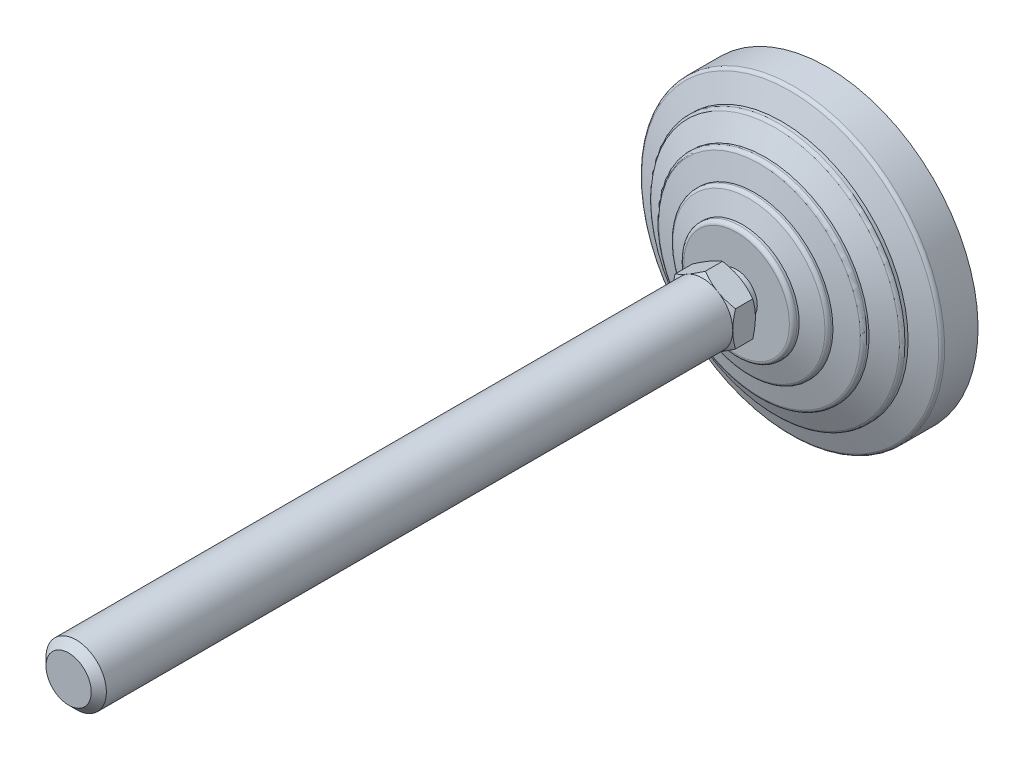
ISO-10303-21;
HEADER;
FILE_DESCRIPTION(('STEP AP214'),'2;1');
FILE_NAME('part.step','',(''),(''),'','','');
FILE_SCHEMA(('AUTOMOTIVE_DESIGN { 1 0 10303 214 1 1 1 1 }'));
ENDSEC;
DATA;
#1=APPLICATION_CONTEXT('core data for automotive mechanical design processes');
#2=APPLICATION_PROTOCOL_DEFINITION('international standard','automotive_design',2000,#1);
#3=PRODUCT_CONTEXT('',#1,'mechanical');
#4=PRODUCT('Part','Part','',(#3));
#5=PRODUCT_RELATED_PRODUCT_CATEGORY('part','',(#4));
#6=PRODUCT_DEFINITION_FORMATION('','',#4);
#7=PRODUCT_DEFINITION_CONTEXT('part definition',#1,'design');
#8=PRODUCT_DEFINITION('design','',#6,#7);
#9=PRODUCT_DEFINITION_SHAPE('','',#8);
#10=(LENGTH_UNIT() NAMED_UNIT(*) SI_UNIT(.MILLI.,.METRE.));
#11=(NAMED_UNIT(*) PLANE_ANGLE_UNIT() SI_UNIT($,.RADIAN.));
#12=(NAMED_UNIT(*) SI_UNIT($,.STERADIAN.) SOLID_ANGLE_UNIT());
#13=UNCERTAINTY_MEASURE_WITH_UNIT(LENGTH_MEASURE(1.E-05),#10,'distance_accuracy_value','');
#14=(GEOMETRIC_REPRESENTATION_CONTEXT(3) GLOBAL_UNCERTAINTY_ASSIGNED_CONTEXT((#13)) GLOBAL_UNIT_ASSIGNED_CONTEXT((#10,
#11,#12)) REPRESENTATION_CONTEXT('',''));
#15=CARTESIAN_POINT('',(0.,0.,0.));
#16=DIRECTION('',(0.,0.,1.));
#17=DIRECTION('',(1.,0.,0.));
#18=AXIS2_PLACEMENT_3D('',#15,#16,#17);
#19=CARTESIAN_POINT('',(-7.76470588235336,0.,27.));
#20=DIRECTION('',(0.,0.,1.));
#21=DIRECTION('',(0.,-1.,0.));
#22=AXIS2_PLACEMENT_3D('',#19,#20,#21);
#23=PLANE('',#22);
#24=CARTESIAN_POINT('',(0.,0.,27.));
#25=DIRECTION('',(0.,0.,-1.));
#26=DIRECTION('',(0.,1.,0.));
#27=AXIS2_PLACEMENT_3D('',#24,#25,#26);
#28=CIRCLE('',#27,5.5000000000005);
#29=CARTESIAN_POINT('',(0.,5.5000000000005,27.));
#30=VERTEX_POINT('',#29);
#31=EDGE_CURVE('E330',#30,#30,#28,.T.);
#32=ORIENTED_EDGE('',*,*,#31,.F.);
#33=EDGE_LOOP('',(#32));
#34=FACE_BOUND('',#33,.T.);
#35=CARTESIAN_POINT('',(0.,0.,27.));
#36=DIRECTION('',(0.,0.,-1.));
#37=DIRECTION('',(-1.,0.,0.));
#38=AXIS2_PLACEMENT_3D('',#35,#36,#37);
#39=CIRCLE('',#38,8.00000000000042);
#40=CARTESIAN_POINT('',(4.,6.92820323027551,27.));
#41=VERTEX_POINT('',#40);
#42=CARTESIAN_POINT('',(8.,0.,27.));
#43=VERTEX_POINT('',#42);
#44=EDGE_CURVE('E477',#41,#43,#39,.T.);
#45=ORIENTED_EDGE('',*,*,#44,.T.);
#46=CARTESIAN_POINT('',(4.,-6.92820323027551,27.));
#47=VERTEX_POINT('',#46);
#48=EDGE_CURVE('E140',#43,#47,#39,.T.);
#49=ORIENTED_EDGE('',*,*,#48,.T.);
#50=CARTESIAN_POINT('',(-4.,-6.92820323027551,27.));
#51=VERTEX_POINT('',#50);
#52=EDGE_CURVE('E139',#47,#51,#39,.T.);
#53=ORIENTED_EDGE('',*,*,#52,.T.);
#54=CARTESIAN_POINT('',(-8.,0.,27.));
#55=VERTEX_POINT('',#54);
#56=EDGE_CURVE('E117',#51,#55,#39,.T.);
#57=ORIENTED_EDGE('',*,*,#56,.T.);
#58=CARTESIAN_POINT('',(-4.,6.92820323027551,27.));
#59=VERTEX_POINT('',#58);
#60=EDGE_CURVE('E105',#55,#59,#39,.T.);
#61=ORIENTED_EDGE('',*,*,#60,.T.);
#62=EDGE_CURVE('E34',#59,#41,#39,.T.);
#63=ORIENTED_EDGE('',*,*,#62,.T.);
#64=EDGE_LOOP('',(#45,#49,#53,#57,#61,#63));
#65=FACE_BOUND('',#64,.T.);
#66=ADVANCED_FACE('F14',(#34,#65),#23,.F.);
#67=CARTESIAN_POINT('',(0.,0.,0.));
#68=DIRECTION('',(0.,0.,-1.));
#69=DIRECTION('',(0.,1.,0.));
#70=AXIS2_PLACEMENT_3D('',#67,#68,#69);
#71=CYLINDRICAL_SURFACE('',#70,5.5000000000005);
#72=CARTESIAN_POINT('',(0.,0.,24.));
#73=DIRECTION('',(0.,0.,-1.));
#74=DIRECTION('',(0.,1.,0.));
#75=AXIS2_PLACEMENT_3D('',#72,#73,#74);
#76=CIRCLE('',#75,5.5000000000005);
#77=CARTESIAN_POINT('',(0.,5.5000000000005,24.));
#78=VERTEX_POINT('',#77);
#79=EDGE_CURVE('E335',#78,#78,#76,.T.);
#80=ORIENTED_EDGE('',*,*,#79,.F.);
#81=EDGE_LOOP('',(#80));
#82=FACE_BOUND('',#81,.T.);
#83=ORIENTED_EDGE('',*,*,#31,.T.);
#84=EDGE_LOOP('',(#83));
#85=FACE_BOUND('',#84,.T.);
#86=ADVANCED_FACE('F297',(#82,#85),#71,.T.);
#87=CARTESIAN_POINT('',(-5.5000000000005,0.,24.));
#88=DIRECTION('',(0.,0.,-1.));
#89=DIRECTION('',(0.,1.,0.));
#90=AXIS2_PLACEMENT_3D('',#87,#88,#89);
#91=PLANE('',#90);
#92=CARTESIAN_POINT('',(0.,0.,24.));
#93=DIRECTION('',(0.,0.,-1.));
#94=DIRECTION('',(0.,1.,0.));
#95=AXIS2_PLACEMENT_3D('',#92,#93,#94);
#96=CIRCLE('',#95,13.9999999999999);
#97=CARTESIAN_POINT('',(0.,13.9999999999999,24.));
#98=VERTEX_POINT('',#97);
#99=EDGE_CURVE('E338',#98,#98,#96,.T.);
#100=ORIENTED_EDGE('',*,*,#99,.F.);
#101=EDGE_LOOP('',(#100));
#102=FACE_BOUND('',#101,.T.);
#103=ORIENTED_EDGE('',*,*,#79,.T.);
#104=EDGE_LOOP('',(#103));
#105=FACE_BOUND('',#104,.T.);
#106=ADVANCED_FACE('F293',(#102,#105),#91,.F.);
#107=CARTESIAN_POINT('',(0.,0.,23.));
#108=DIRECTION('',(0.,0.,-1.));
#109=DIRECTION('',(0.,1.,0.));
#110=AXIS2_PLACEMENT_3D('',#107,#108,#109);
#111=TOROIDAL_SURFACE('',#110,13.9999999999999,1.);
#112=CARTESIAN_POINT('',(0.,0.,23.));
#113=DIRECTION('',(0.,0.,-1.));
#114=DIRECTION('',(0.,1.,0.));
#115=AXIS2_PLACEMENT_3D('',#112,#113,#114);
#116=CIRCLE('',#115,14.9999999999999);
#117=CARTESIAN_POINT('',(0.,14.9999999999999,23.));
#118=VERTEX_POINT('',#117);
#119=EDGE_CURVE('E341',#118,#118,#116,.T.);
#120=ORIENTED_EDGE('',*,*,#119,.F.);
#121=EDGE_LOOP('',(#120));
#122=FACE_BOUND('',#121,.T.);
#123=ORIENTED_EDGE('',*,*,#99,.T.);
#124=EDGE_LOOP('',(#123));
#125=FACE_BOUND('',#124,.T.);
#126=ADVANCED_FACE('F289',(#122,#125),#111,.T.);
#127=CARTESIAN_POINT('',(0.,0.,0.));
#128=DIRECTION('',(0.,0.,-1.));
#129=DIRECTION('',(0.,1.,0.));
#130=AXIS2_PLACEMENT_3D('',#127,#128,#129);
#131=CYLINDRICAL_SURFACE('',#130,14.9999999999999);
#132=CARTESIAN_POINT('',(0.,0.,22.4025287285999));
#133=DIRECTION('',(0.,0.,-1.));
#134=DIRECTION('',(0.,1.,0.));
#135=AXIS2_PLACEMENT_3D('',#132,#133,#134);
#136=CIRCLE('',#135,14.9999999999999);
#137=CARTESIAN_POINT('',(0.,14.9999999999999,22.4025287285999));
#138=VERTEX_POINT('',#137);
#139=EDGE_CURVE('E344',#138,#138,#136,.T.);
#140=ORIENTED_EDGE('',*,*,#139,.F.);
#141=EDGE_LOOP('',(#140));
#142=FACE_BOUND('',#141,.T.);
#143=ORIENTED_EDGE('',*,*,#119,.T.);
#144=EDGE_LOOP('',(#143));
#145=FACE_BOUND('',#144,.T.);
#146=ADVANCED_FACE('F285',(#142,#145),#131,.T.);
#147=CARTESIAN_POINT('',(0.,0.,22.4025287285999));
#148=DIRECTION('',(0.,0.,-1.));
#149=DIRECTION('',(0.,1.,0.));
#150=AXIS2_PLACEMENT_3D('',#147,#148,#149);
#151=CONICAL_SURFACE('',#150,14.9999999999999,1.25589726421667);
#152=CARTESIAN_POINT('',(0.,0.,20.7216684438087));
#153=DIRECTION('',(0.,0.,-1.));
#154=DIRECTION('',(0.,1.,0.));
#155=AXIS2_PLACEMENT_3D('',#152,#153,#154);
#156=CIRCLE('',#155,20.1601635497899);
#157=CARTESIAN_POINT('',(0.,20.1601635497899,20.7216684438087));
#158=VERTEX_POINT('',#157);
#159=EDGE_CURVE('E347',#158,#158,#156,.T.);
#160=ORIENTED_EDGE('',*,*,#159,.F.);
#161=EDGE_LOOP('',(#160));
#162=FACE_BOUND('',#161,.T.);
#163=ORIENTED_EDGE('',*,*,#139,.T.);
#164=EDGE_LOOP('',(#163));
#165=FACE_BOUND('',#164,.T.);
#166=ADVANCED_FACE('F281',(#162,#165),#151,.T.);
#167=CARTESIAN_POINT('',(0.,0.,19.7708407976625));
#168=DIRECTION('',(0.,0.,-1.));
#169=DIRECTION('',(0.,1.,0.));
#170=AXIS2_PLACEMENT_3D('',#167,#168,#169);
#171=TOROIDAL_SURFACE('',#170,19.8504430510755,1.);
#172=CARTESIAN_POINT('',(0.,0.,19.7708407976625));
#173=DIRECTION('',(0.,0.,-1.));
#174=DIRECTION('',(0.,1.,0.));
#175=AXIS2_PLACEMENT_3D('',#172,#173,#174);
#176=CIRCLE('',#175,20.8504430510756);
#177=CARTESIAN_POINT('',(0.,20.8504430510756,19.7708407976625));
#178=VERTEX_POINT('',#177);
#179=EDGE_CURVE('E350',#178,#178,#176,.T.);
#180=ORIENTED_EDGE('',*,*,#179,.F.);
#181=EDGE_LOOP('',(#180));
#182=FACE_BOUND('',#181,.T.);
#183=ORIENTED_EDGE('',*,*,#159,.T.);
#184=EDGE_LOOP('',(#183));
#185=FACE_BOUND('',#184,.T.);
#186=ADVANCED_FACE('F277',(#182,#185),#171,.T.);
#187=CARTESIAN_POINT('',(0.,0.,0.));
#188=DIRECTION('',(0.,0.,-1.));
#189=DIRECTION('',(0.,1.,0.));
#190=AXIS2_PLACEMENT_3D('',#187,#188,#189);
#191=CYLINDRICAL_SURFACE('',#190,20.8504430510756);
#192=CARTESIAN_POINT('',(0.,0.,19.2987385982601));
#193=DIRECTION('',(0.,0.,-1.));
#194=DIRECTION('',(0.,1.,0.));
#195=AXIS2_PLACEMENT_3D('',#192,#193,#194);
#196=CIRCLE('',#195,20.8504430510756);
#197=CARTESIAN_POINT('',(0.,20.8504430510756,19.2987385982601));
#198=VERTEX_POINT('',#197);
#199=EDGE_CURVE('E353',#198,#198,#196,.T.);
#200=ORIENTED_EDGE('',*,*,#199,.F.);
#201=EDGE_LOOP('',(#200));
#202=FACE_BOUND('',#201,.T.);
#203=ORIENTED_EDGE('',*,*,#179,.T.);
#204=EDGE_LOOP('',(#203));
#205=FACE_BOUND('',#204,.T.);
#206=ADVANCED_FACE('F273',(#202,#205),#191,.T.);
#207=CARTESIAN_POINT('',(0.,0.,19.2987385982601));
#208=DIRECTION('',(0.,0.,-1.));
#209=DIRECTION('',(0.,1.,0.));
#210=AXIS2_PLACEMENT_3D('',#207,#208,#209);
#211=CONICAL_SURFACE('',#210,20.8504430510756,1.34067144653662);
#212=CARTESIAN_POINT('',(0.,0.,17.9217501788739));
#213=DIRECTION('',(0.,0.,-1.));
#214=DIRECTION('',(0.,1.,0.));
#215=AXIS2_PLACEMENT_3D('',#212,#213,#214);
#216=CIRCLE('',#215,26.7280991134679);
#217=CARTESIAN_POINT('',(0.,26.7280991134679,17.9217501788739));
#218=VERTEX_POINT('',#217);
#219=EDGE_CURVE('E356',#218,#218,#216,.T.);
#220=ORIENTED_EDGE('',*,*,#219,.F.);
#221=EDGE_LOOP('',(#220));
#222=FACE_BOUND('',#221,.T.);
#223=ORIENTED_EDGE('',*,*,#199,.T.);
#224=EDGE_LOOP('',(#223));
#225=FACE_BOUND('',#224,.T.);
#226=ADVANCED_FACE('F269',(#222,#225),#211,.T.);
#227=CARTESIAN_POINT('',(0.,0.,16.9481122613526));
#228=DIRECTION('',(0.,0.,-1.));
#229=DIRECTION('',(0.,1.,0.));
#230=AXIS2_PLACEMENT_3D('',#227,#228,#229);
#231=TOROIDAL_SURFACE('',#230,26.5,1.);
#232=CARTESIAN_POINT('',(0.,0.,16.9481122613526));
#233=DIRECTION('',(0.,0.,-1.));
#234=DIRECTION('',(0.,1.,0.));
#235=AXIS2_PLACEMENT_3D('',#232,#233,#234);
#236=CIRCLE('',#235,27.5);
#237=CARTESIAN_POINT('',(0.,27.5,16.9481122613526));
#238=VERTEX_POINT('',#237);
#239=EDGE_CURVE('E359',#238,#238,#236,.T.);
#240=ORIENTED_EDGE('',*,*,#239,.F.);
#241=EDGE_LOOP('',(#240));
#242=FACE_BOUND('',#241,.T.);
#243=ORIENTED_EDGE('',*,*,#219,.T.);
#244=EDGE_LOOP('',(#243));
#245=FACE_BOUND('',#244,.T.);
#246=ADVANCED_FACE('F265',(#242,#245),#231,.T.);
#247=CARTESIAN_POINT('',(0.,0.,0.));
#248=DIRECTION('',(0.,0.,-1.));
#249=DIRECTION('',(0.,1.,0.));
#250=AXIS2_PLACEMENT_3D('',#247,#248,#249);
#251=CYLINDRICAL_SURFACE('',#250,27.5);
#252=CARTESIAN_POINT('',(0.,0.,16.4025287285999));
#253=DIRECTION('',(0.,0.,-1.));
#254=DIRECTION('',(0.,1.,0.));
#255=AXIS2_PLACEMENT_3D('',#252,#253,#254);
#256=CIRCLE('',#255,27.5);
#257=CARTESIAN_POINT('',(0.,27.5,16.4025287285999));
#258=VERTEX_POINT('',#257);
#259=EDGE_CURVE('E362',#258,#258,#256,.T.);
#260=ORIENTED_EDGE('',*,*,#259,.F.);
#261=EDGE_LOOP('',(#260));
#262=FACE_BOUND('',#261,.T.);
#263=ORIENTED_EDGE('',*,*,#239,.T.);
#264=EDGE_LOOP('',(#263));
#265=FACE_BOUND('',#264,.T.);
#266=ADVANCED_FACE('F261',(#262,#265),#251,.T.);
#267=CARTESIAN_POINT('',(0.,0.,16.4025287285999));
#268=DIRECTION('',(0.,0.,-1.));
#269=DIRECTION('',(0.,1.,0.));
#270=AXIS2_PLACEMENT_3D('',#267,#268,#269);
#271=CONICAL_SURFACE('',#270,27.5,1.12022914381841);
#272=CARTESIAN_POINT('',(0.,0.,13.7730910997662));
#273=DIRECTION('',(0.,0.,-1.));
#274=DIRECTION('',(0.,1.,0.));
#275=AXIS2_PLACEMENT_3D('',#272,#273,#274);
#276=CIRCLE('',#275,32.935476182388);
#277=CARTESIAN_POINT('',(0.,32.935476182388,13.7730910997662));
#278=VERTEX_POINT('',#277);
#279=EDGE_CURVE('E365',#278,#278,#276,.T.);
#280=ORIENTED_EDGE('',*,*,#279,.F.);
#281=EDGE_LOOP('',(#280));
#282=FACE_BOUND('',#281,.T.);
#283=ORIENTED_EDGE('',*,*,#259,.T.);
#284=EDGE_LOOP('',(#283));
#285=FACE_BOUND('',#284,.T.);
#286=ADVANCED_FACE('F257',(#282,#285),#271,.T.);
#287=CARTESIAN_POINT('',(0.,0.,12.8728908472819));
#288=DIRECTION('',(0.,0.,-1.));
#289=DIRECTION('',(0.,1.,0.));
#290=AXIS2_PLACEMENT_3D('',#287,#288,#289);
#291=TOROIDAL_SURFACE('',#290,32.5,1.);
#292=CARTESIAN_POINT('',(0.,0.,12.8728908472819));
#293=DIRECTION('',(0.,0.,-1.));
#294=DIRECTION('',(0.,1.,0.));
#295=AXIS2_PLACEMENT_3D('',#292,#293,#294);
#296=CIRCLE('',#295,33.5);
#297=CARTESIAN_POINT('',(0.,33.5,12.8728908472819));
#298=VERTEX_POINT('',#297);
#299=EDGE_CURVE('E368',#298,#298,#296,.T.);
#300=ORIENTED_EDGE('',*,*,#299,.F.);
#301=EDGE_LOOP('',(#300));
#302=FACE_BOUND('',#301,.T.);
#303=ORIENTED_EDGE('',*,*,#279,.T.);
#304=EDGE_LOOP('',(#303));
#305=FACE_BOUND('',#304,.T.);
#306=ADVANCED_FACE('F253',(#302,#305),#291,.T.);
#307=CARTESIAN_POINT('',(0.,0.,0.));
#308=DIRECTION('',(0.,0.,-1.));
#309=DIRECTION('',(0.,1.,0.));
#310=AXIS2_PLACEMENT_3D('',#307,#308,#309);
#311=CYLINDRICAL_SURFACE('',#310,33.5);
#312=CARTESIAN_POINT('',(0.,0.,12.0315037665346));
#313=DIRECTION('',(0.,0.,-1.));
#314=DIRECTION('',(0.,1.,0.));
#315=AXIS2_PLACEMENT_3D('',#312,#313,#314);
#316=CIRCLE('',#315,33.5);
#317=CARTESIAN_POINT('',(0.,33.5,12.0315037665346));
#318=VERTEX_POINT('',#317);
#319=EDGE_CURVE('E371',#318,#318,#316,.T.);
#320=ORIENTED_EDGE('',*,*,#319,.F.);
#321=EDGE_LOOP('',(#320));
#322=FACE_BOUND('',#321,.T.);
#323=ORIENTED_EDGE('',*,*,#299,.T.);
#324=EDGE_LOOP('',(#323));
#325=FACE_BOUND('',#324,.T.);
#326=ADVANCED_FACE('F249',(#322,#325),#311,.T.);
#327=CARTESIAN_POINT('',(0.,0.,12.0315037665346));
#328=DIRECTION('',(0.,0.,-1.));
#329=DIRECTION('',(0.,1.,0.));
#330=AXIS2_PLACEMENT_3D('',#327,#328,#329);
#331=CONICAL_SURFACE('',#330,33.5,1.20362249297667);
#332=CARTESIAN_POINT('',(0.,0.,9.77805027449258));
#333=DIRECTION('',(0.,0.,-1.));
#334=DIRECTION('',(0.,1.,0.));
#335=AXIS2_PLACEMENT_3D('',#332,#333,#334);
#336=CIRCLE('',#335,39.3589790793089);
#337=CARTESIAN_POINT('',(0.,39.3589790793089,9.77805027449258));
#338=VERTEX_POINT('',#337);
#339=EDGE_CURVE('E374',#338,#338,#336,.T.);
#340=ORIENTED_EDGE('',*,*,#339,.F.);
#341=EDGE_LOOP('',(#340));
#342=FACE_BOUND('',#341,.T.);
#343=ORIENTED_EDGE('',*,*,#319,.T.);
#344=EDGE_LOOP('',(#343));
#345=FACE_BOUND('',#344,.T.);
#346=ADVANCED_FACE('F245',(#342,#345),#331,.T.);
#347=CARTESIAN_POINT('',(0.,0.,8.84470466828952));
#348=DIRECTION('',(0.,0.,-1.));
#349=DIRECTION('',(0.,1.,0.));
#350=AXIS2_PLACEMENT_3D('',#347,#348,#349);
#351=TOROIDAL_SURFACE('',#350,39.,1.);
#352=CARTESIAN_POINT('',(0.,0.,8.84470466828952));
#353=DIRECTION('',(0.,0.,-1.));
#354=DIRECTION('',(0.,1.,0.));
#355=AXIS2_PLACEMENT_3D('',#352,#353,#354);
#356=CIRCLE('',#355,40.);
#357=CARTESIAN_POINT('',(0.,40.,8.84470466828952));
#358=VERTEX_POINT('',#357);
#359=EDGE_CURVE('E377',#358,#358,#356,.T.);
#360=ORIENTED_EDGE('',*,*,#359,.F.);
#361=EDGE_LOOP('',(#360));
#362=FACE_BOUND('',#361,.T.);
#363=ORIENTED_EDGE('',*,*,#339,.T.);
#364=EDGE_LOOP('',(#363));
#365=FACE_BOUND('',#364,.T.);
#366=ADVANCED_FACE('F241',(#362,#365),#351,.T.);
#367=CARTESIAN_POINT('',(0.,0.,0.));
#368=DIRECTION('',(0.,0.,-1.));
#369=DIRECTION('',(0.,1.,0.));
#370=AXIS2_PLACEMENT_3D('',#367,#368,#369);
#371=CYLINDRICAL_SURFACE('',#370,40.);
#372=CARTESIAN_POINT('',(0.,0.,0.));
#373=DIRECTION('',(0.,0.,-1.));
#374=DIRECTION('',(0.,1.,0.));
#375=AXIS2_PLACEMENT_3D('',#372,#373,#374);
#376=CIRCLE('',#375,40.);
#377=CARTESIAN_POINT('',(0.,40.,0.));
#378=VERTEX_POINT('',#377);
#379=EDGE_CURVE('E380',#378,#378,#376,.T.);
#380=ORIENTED_EDGE('',*,*,#379,.F.);
#381=EDGE_LOOP('',(#380));
#382=FACE_BOUND('',#381,.T.);
#383=ORIENTED_EDGE('',*,*,#359,.T.);
#384=EDGE_LOOP('',(#383));
#385=FACE_BOUND('',#384,.T.);
#386=ADVANCED_FACE('F237',(#382,#385),#371,.T.);
#387=CARTESIAN_POINT('',(0.,0.,0.));
#388=DIRECTION('',(0.,0.,1.));
#389=DIRECTION('',(0.,-1.,0.));
#390=AXIS2_PLACEMENT_3D('',#387,#388,#389);
#391=PLANE('',#390);
#392=ORIENTED_EDGE('',*,*,#379,.T.);
#393=EDGE_LOOP('',(#392));
#394=FACE_BOUND('',#393,.T.);
#395=ADVANCED_FACE('F233',(#394),#391,.F.);
#396=CARTESIAN_POINT('',(0.,0.,28.6343823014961));
#397=DIRECTION('',(0.,0.,1.));
#398=DIRECTION('',(1.,0.,0.));
#399=AXIS2_PLACEMENT_3D('',#396,#397,#398);
#400=CONICAL_SURFACE('',#399,10.8308331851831,1.0471975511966);
#401=CARTESIAN_POINT('',(8.,-12.3777900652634,30.8902065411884));
#402=CARTESIAN_POINT('',(8.,-12.0286249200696,30.7209464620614));
#403=CARTESIAN_POINT('',(8.,-11.6786551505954,30.5533176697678));
#404=CARTESIAN_POINT('',(8.,-10.9766783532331,30.2222406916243));
#405=CARTESIAN_POINT('',(8.,-10.6246710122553,30.0587931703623));
#406=CARTESIAN_POINT('',(8.,-9.9163634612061,29.7361682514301));
#407=CARTESIAN_POINT('',(8.,-9.56005029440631,29.577019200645));
#408=CARTESIAN_POINT('',(8.,-8.84457997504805,29.2652725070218));
#409=CARTESIAN_POINT('',(8.,-8.48542295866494,29.1126745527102));
#410=CARTESIAN_POINT('',(8.,-7.75219915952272,28.8110319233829));
#411=CARTESIAN_POINT('',(8.,-7.37802164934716,28.6622549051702));
#412=CARTESIAN_POINT('',(8.,-6.62527921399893,28.3760309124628));
#413=CARTESIAN_POINT('',(8.,-6.24671380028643,28.2385852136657));
#414=CARTESIAN_POINT('',(8.,-5.48530670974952,27.9786537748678));
#415=CARTESIAN_POINT('',(8.,-5.10247557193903,27.8561374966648));
#416=CARTESIAN_POINT('',(8.,-4.33133570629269,27.6300136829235));
#417=CARTESIAN_POINT('',(8.,-3.9430287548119,27.5264001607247));
#418=CARTESIAN_POINT('',(8.,-3.16280898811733,27.3436316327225));
#419=CARTESIAN_POINT('',(8.,-2.77092794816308,27.264344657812));
#420=CARTESIAN_POINT('',(8.,-2.17956092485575,27.1671044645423));
#421=CARTESIAN_POINT('',(8.,-1.98183289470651,27.1383047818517));
#422=CARTESIAN_POINT('',(8.,-1.58540387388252,27.0885010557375));
#423=CARTESIAN_POINT('',(8.,-1.38670297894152,27.0674962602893));
#424=CARTESIAN_POINT('',(8.,-0.991177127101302,27.0339626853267));
#425=CARTESIAN_POINT('',(8.,-0.794361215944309,27.0213276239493));
#426=CARTESIAN_POINT('',(8.,-0.40037159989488,27.0043897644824));
#427=CARTESIAN_POINT('',(8.,-0.203197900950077,27.0000868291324));
#428=CARTESIAN_POINT('',(8.,0.191154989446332,26.999915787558));
#429=CARTESIAN_POINT('',(8.,0.388334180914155,27.0040477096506));
#430=CARTESIAN_POINT('',(8.,0.782344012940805,27.0206458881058));
#431=CARTESIAN_POINT('',(8.,0.979174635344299,27.0331125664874));
#432=CARTESIAN_POINT('',(8.,1.45310942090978,27.072901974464));
#433=CARTESIAN_POINT('',(8.,1.72988442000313,27.104228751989));
#434=CARTESIAN_POINT('',(8.,2.28134804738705,27.1816464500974));
#435=CARTESIAN_POINT('',(8.,2.55603638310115,27.2277394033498));
#436=CARTESIAN_POINT('',(8.,3.37667631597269,27.385720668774));
#437=CARTESIAN_POINT('',(8.,3.91888905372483,27.5172815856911));
#438=CARTESIAN_POINT('',(8.,4.72957772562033,27.7450113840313));
#439=CARTESIAN_POINT('',(8.,5.00226936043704,27.8270326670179));
#440=CARTESIAN_POINT('',(8.,5.54500349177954,27.9994937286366));
#441=CARTESIAN_POINT('',(8.,5.81504597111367,28.0899335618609));
#442=CARTESIAN_POINT('',(8.,6.35256841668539,28.2777890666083));
#443=CARTESIAN_POINT('',(8.,6.62004921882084,28.3752023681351));
#444=CARTESIAN_POINT('',(8.,7.15280175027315,28.5758687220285));
#445=CARTESIAN_POINT('',(8.,7.41807350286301,28.6791217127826));
#446=CARTESIAN_POINT('',(8.,8.03319577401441,28.9251038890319));
#447=CARTESIAN_POINT('',(8.,8.38230236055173,29.0696897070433));
#448=CARTESIAN_POINT('',(8.,9.07762902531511,29.3656623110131));
#449=CARTESIAN_POINT('',(8.,9.42384894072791,29.5170494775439));
#450=CARTESIAN_POINT('',(8.,10.113918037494,29.8252906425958));
#451=CARTESIAN_POINT('',(8.,10.4577667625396,29.9821456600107));
#452=CARTESIAN_POINT('',(8.,11.1434271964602,30.3002541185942));
#453=CARTESIAN_POINT('',(8.,11.4852388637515,30.4615076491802));
#454=CARTESIAN_POINT('',(8.,12.1674893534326,30.7877671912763));
#455=CARTESIAN_POINT('',(8.,12.5079264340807,30.952776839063));
#456=CARTESIAN_POINT('',(8.,13.187346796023,31.2857651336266));
#457=CARTESIAN_POINT('',(8.,13.526330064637,31.4537438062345));
#458=CARTESIAN_POINT('',(8.,14.5413549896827,31.96131764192));
#459=CARTESIAN_POINT('',(8.,15.2155568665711,32.3045916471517));
#460=CARTESIAN_POINT('',(8.,16.5057244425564,32.9699061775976));
#461=CARTESIAN_POINT('',(8.,17.1219705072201,33.2914054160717));
#462=CARTESIAN_POINT('',(8.,18.352150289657,33.9388432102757));
#463=CARTESIAN_POINT('',(8.,18.9660839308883,34.2647819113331));
#464=CARTESIAN_POINT('',(8.,20.1906785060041,34.9192711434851));
#465=CARTESIAN_POINT('',(8.,20.801343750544,35.2478136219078));
#466=CARTESIAN_POINT('',(8.,22.0211888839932,35.9075691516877));
#467=CARTESIAN_POINT('',(8.,22.6303688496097,36.2387820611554));
#468=CARTESIAN_POINT('',(8.,23.2389989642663,36.5709955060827));
#469=B_SPLINE_CURVE_WITH_KNOTS('',3,(#401,#402,#403,#404,#405,#406,#407,#408,#409,#410,#411,
#412,#413,#414,#415,#416,#417,#418,#419,#420,#421,#422,#423,#424,#425,#426,#427,#428,#429,#430,
#431,#432,#433,#434,#435,#436,#437,#438,#439,#440,#441,#442,#443,#444,#445,#446,#447,#448,#449,
#450,#451,#452,#453,#454,#455,#456,#457,#458,#459,#460,#461,#462,#463,#464,#465,#466,#467,#468),
.UNSPECIFIED.,.F.,.F.,(4,2,2,2,2,2,2,2,2,2,2,2,2,2,2,2,2,2,2,2,2,2,2,2,2,2,2,2,2,2,2,2,2,4),(0.,
1.16409658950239,2.3283770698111,3.49904514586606,4.66965750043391,5.87752616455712,
7.08553062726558,8.29102108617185,9.4961290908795,10.6945789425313,11.2938926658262,
11.893148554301,12.4846410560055,13.0761238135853,13.6676085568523,14.2591232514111,
15.094277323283,15.9295464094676,17.6010259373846,18.4552357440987,19.30945109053,
20.1633774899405,21.0172948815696,22.1507880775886,23.2843447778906,24.4181138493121,
25.5519059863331,26.686846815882,27.8217975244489,30.0914155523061,32.1766033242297,
34.2618595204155,36.342157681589,38.4223460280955),.UNSPECIFIED.);
#470=CARTESIAN_POINT('',(8.,4.61880215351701,27.714531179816));
#471=VERTEX_POINT('',#470);
#472=EDGE_CURVE('E115',#471,#43,#469,.F.);
#473=ORIENTED_EDGE('',*,*,#472,.T.);
#474=ORIENTED_EDGE('',*,*,#44,.F.);
#475=CARTESIAN_POINT('',(-0.000199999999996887,9.23771977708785,27.7145978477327));
#476=CARTESIAN_POINT('',(0.175648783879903,9.13619343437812,27.655990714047));
#477=CARTESIAN_POINT('',(0.352153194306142,9.03428856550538,27.600043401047));
#478=CARTESIAN_POINT('',(0.706595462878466,8.82965122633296,27.4942010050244));
#479=CARTESIAN_POINT('',(0.884533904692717,8.72691841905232,27.4443085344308));
#480=CARTESIAN_POINT('',(1.42119823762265,8.41707512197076,27.3046927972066));
#481=CARTESIAN_POINT('',(1.78204258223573,8.20874154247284,27.2252811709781));
#482=CARTESIAN_POINT('',(2.32203917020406,7.89697436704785,27.1321616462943));
#483=CARTESIAN_POINT('',(2.49957818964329,7.79447216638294,27.1056345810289));
#484=CARTESIAN_POINT('',(2.8554591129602,7.58900421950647,27.0611531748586));
#485=CARTESIAN_POINT('',(3.03380094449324,7.4860385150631,27.0431980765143));
#486=CARTESIAN_POINT('',(3.3907916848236,7.27992981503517,27.0163156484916));
#487=CARTESIAN_POINT('',(3.5694400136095,7.17678715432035,27.007378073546));
#488=CARTESIAN_POINT('',(3.92690170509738,6.97040655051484,26.9987223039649));
#489=CARTESIAN_POINT('',(4.10571506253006,6.86716861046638,26.9990038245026));
#490=CARTESIAN_POINT('',(4.4400133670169,6.67416139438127,27.0081450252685));
#491=CARTESIAN_POINT('',(4.59552190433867,6.58437849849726,27.0158896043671));
#492=CARTESIAN_POINT('',(4.90617476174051,6.40502298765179,27.0382011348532));
#493=CARTESIAN_POINT('',(5.06131905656,6.31545038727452,27.0527685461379));
#494=CARTESIAN_POINT('',(5.52615131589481,6.04707935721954,27.1063606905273));
#495=CARTESIAN_POINT('',(5.83501648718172,5.86875596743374,27.1552686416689));
#496=CARTESIAN_POINT('',(6.4560232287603,5.51021755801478,27.2775394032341));
#497=CARTESIAN_POINT('',(6.76808554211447,5.33004829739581,27.3514205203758));
#498=CARTESIAN_POINT('',(7.38755648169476,4.97239658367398,27.5191001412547));
#499=CARTESIAN_POINT('',(7.69497304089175,4.79490955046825,27.6128592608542));
#500=CARTESIAN_POINT('',(8.0002,4.61868668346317,27.7145978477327));
#501=B_SPLINE_CURVE_WITH_KNOTS('',3,(#475,#476,#477,#478,#479,#480,#481,#482,#483,#484,#485,
#486,#487,#488,#489,#490,#491,#492,#493,#494,#495,#496,#497,#498,#499,#500),.UNSPECIFIED.,.F.,
.F.,(4,2,2,2,2,2,2,2,2,2,2,2,4),(0.,0.633973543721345,1.26821965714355,2.53934712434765,
3.15934343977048,3.77928496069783,4.39852133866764,5.01773858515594,5.55680239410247,
6.09590254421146,7.17487077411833,8.27776850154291,9.37850115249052),.UNSPECIFIED.);
#502=EDGE_CURVE('E18',#41,#471,#501,.T.);
#503=ORIENTED_EDGE('',*,*,#502,.T.);
#504=EDGE_LOOP('',(#473,#474,#503));
#505=FACE_BOUND('',#504,.T.);
#506=ADVANCED_FACE('F157',(#505),#400,.T.);
#507=CARTESIAN_POINT('',(-8.0002,4.61868668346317,27.7145978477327));
#508=CARTESIAN_POINT('',(-7.8243512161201,4.7202130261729,27.655990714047));
#509=CARTESIAN_POINT('',(-7.64784680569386,4.82211789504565,27.600043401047));
#510=CARTESIAN_POINT('',(-7.29340453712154,5.02675523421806,27.4942010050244));
#511=CARTESIAN_POINT('',(-7.11546609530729,5.1294880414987,27.4443085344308));
#512=CARTESIAN_POINT('',(-6.57880176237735,5.43933133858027,27.3046927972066));
#513=CARTESIAN_POINT('',(-6.21795741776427,5.64766491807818,27.2252811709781));
#514=CARTESIAN_POINT('',(-5.67796082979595,5.95943209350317,27.1321616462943));
#515=CARTESIAN_POINT('',(-5.50042181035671,6.06193429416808,27.1056345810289));
#516=CARTESIAN_POINT('',(-5.1445408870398,6.26740224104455,27.0611531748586));
#517=CARTESIAN_POINT('',(-4.96619905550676,6.37036794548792,27.0431980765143));
#518=CARTESIAN_POINT('',(-4.6092083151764,6.57647664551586,27.0163156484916));
#519=CARTESIAN_POINT('',(-4.4305599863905,6.67961930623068,27.007378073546));
#520=CARTESIAN_POINT('',(-4.07309829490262,6.88599991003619,26.9987223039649));
#521=CARTESIAN_POINT('',(-3.89428493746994,6.98923785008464,26.9990038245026));
#522=CARTESIAN_POINT('',(-3.5599866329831,7.18224506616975,27.0081450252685));
#523=CARTESIAN_POINT('',(-3.40447809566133,7.27202796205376,27.0158896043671));
#524=CARTESIAN_POINT('',(-3.09382523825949,7.45138347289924,27.0382011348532));
#525=CARTESIAN_POINT('',(-2.93868094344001,7.5409560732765,27.0527685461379));
#526=CARTESIAN_POINT('',(-2.47384868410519,7.80932710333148,27.1063606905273));
#527=CARTESIAN_POINT('',(-2.16498351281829,7.98765049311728,27.1552686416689));
#528=CARTESIAN_POINT('',(-1.54397677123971,8.34618890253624,27.2775394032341));
#529=CARTESIAN_POINT('',(-1.23191445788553,8.52635816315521,27.3514205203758));
#530=CARTESIAN_POINT('',(-0.612443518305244,8.88400987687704,27.5191001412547));
#531=CARTESIAN_POINT('',(-0.30502695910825,9.06149691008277,27.6128592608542));
#532=CARTESIAN_POINT('',(0.000200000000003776,9.23771977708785,27.7145978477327));
#533=B_SPLINE_CURVE_WITH_KNOTS('',3,(#507,#508,#509,#510,#511,#512,#513,#514,#515,#516,#517,
#518,#519,#520,#521,#522,#523,#524,#525,#526,#527,#528,#529,#530,#531,#532),.UNSPECIFIED.,.F.,
.F.,(4,2,2,2,2,2,2,2,2,2,2,2,4),(0.,0.633973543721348,1.26821965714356,2.53934712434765,
3.15934343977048,3.77928496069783,4.39852133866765,5.01773858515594,5.55680239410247,
6.09590254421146,7.17487077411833,8.27776850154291,9.37850115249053),.UNSPECIFIED.);
#534=CARTESIAN_POINT('',(0.,9.23760430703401,27.714531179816));
#535=VERTEX_POINT('',#534);
#536=EDGE_CURVE('E149',#59,#535,#533,.T.);
#537=ORIENTED_EDGE('',*,*,#536,.T.);
#538=EDGE_CURVE('E9',#535,#41,#501,.T.);
#539=ORIENTED_EDGE('',*,*,#538,.T.);
#540=ORIENTED_EDGE('',*,*,#62,.F.);
#541=EDGE_LOOP('',(#537,#539,#540));
#542=FACE_BOUND('',#541,.T.);
#543=ADVANCED_FACE('F470',(#542),#400,.T.);
#544=CARTESIAN_POINT('',(8.0002,-4.61868668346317,27.7145978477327));
#545=CARTESIAN_POINT('',(7.8243512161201,-4.7202130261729,27.655990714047));
#546=CARTESIAN_POINT('',(7.64784680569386,-4.82211789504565,27.600043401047));
#547=CARTESIAN_POINT('',(7.29340453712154,-5.02675523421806,27.4942010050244));
#548=CARTESIAN_POINT('',(7.11546609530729,-5.1294880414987,27.4443085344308));
#549=CARTESIAN_POINT('',(6.57880176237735,-5.43933133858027,27.3046927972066));
#550=CARTESIAN_POINT('',(6.21795741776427,-5.64766491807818,27.2252811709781));
#551=CARTESIAN_POINT('',(5.67796082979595,-5.95943209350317,27.1321616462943));
#552=CARTESIAN_POINT('',(5.50042181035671,-6.06193429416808,27.1056345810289));
#553=CARTESIAN_POINT('',(5.1445408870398,-6.26740224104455,27.0611531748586));
#554=CARTESIAN_POINT('',(4.96619905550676,-6.37036794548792,27.0431980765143));
#555=CARTESIAN_POINT('',(4.6092083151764,-6.57647664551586,27.0163156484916));
#556=CARTESIAN_POINT('',(4.4305599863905,-6.67961930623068,27.007378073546));
#557=CARTESIAN_POINT('',(4.07309829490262,-6.88599991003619,26.9987223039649));
#558=CARTESIAN_POINT('',(3.89428493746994,-6.98923785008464,26.9990038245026));
#559=CARTESIAN_POINT('',(3.5599866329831,-7.18224506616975,27.0081450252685));
#560=CARTESIAN_POINT('',(3.40447809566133,-7.27202796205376,27.0158896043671));
#561=CARTESIAN_POINT('',(3.0938252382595,-7.45138347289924,27.0382011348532));
#562=CARTESIAN_POINT('',(2.93868094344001,-7.5409560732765,27.0527685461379));
#563=CARTESIAN_POINT('',(2.47384868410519,-7.80932710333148,27.1063606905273));
#564=CARTESIAN_POINT('',(2.16498351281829,-7.98765049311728,27.1552686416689));
#565=CARTESIAN_POINT('',(1.54397677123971,-8.34618890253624,27.2775394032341));
#566=CARTESIAN_POINT('',(1.23191445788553,-8.52635816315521,27.3514205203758));
#567=CARTESIAN_POINT('',(0.612443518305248,-8.88400987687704,27.5191001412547));
#568=CARTESIAN_POINT('',(0.305026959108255,-9.06149691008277,27.6128592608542));
#569=CARTESIAN_POINT('',(-0.000199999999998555,-9.23771977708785,27.7145978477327));
#570=B_SPLINE_CURVE_WITH_KNOTS('',3,(#544,#545,#546,#547,#548,#549,#550,#551,#552,#553,#554,
#555,#556,#557,#558,#559,#560,#561,#562,#563,#564,#565,#566,#567,#568,#569),.UNSPECIFIED.,.F.,
.F.,(4,2,2,2,2,2,2,2,2,2,2,2,4),(0.,0.633973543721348,1.26821965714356,2.53934712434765,
3.15934343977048,3.77928496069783,4.39852133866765,5.01773858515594,5.55680239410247,
6.09590254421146,7.17487077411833,8.27776850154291,9.37850115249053),.UNSPECIFIED.);
#571=CARTESIAN_POINT('',(8.,-4.61880215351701,27.714531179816));
#572=VERTEX_POINT('',#571);
#573=EDGE_CURVE('E135',#572,#47,#570,.T.);
#574=ORIENTED_EDGE('',*,*,#573,.T.);
#575=ORIENTED_EDGE('',*,*,#48,.F.);
#576=EDGE_CURVE('E150',#43,#572,#469,.F.);
#577=ORIENTED_EDGE('',*,*,#576,.T.);
#578=EDGE_LOOP('',(#574,#575,#577));
#579=FACE_BOUND('',#578,.T.);
#580=ADVANCED_FACE('F464',(#579),#400,.T.);
#581=CARTESIAN_POINT('',(0.000200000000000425,-9.23771977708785,27.7145978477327));
#582=CARTESIAN_POINT('',(-0.175648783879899,-9.13619343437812,27.655990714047));
#583=CARTESIAN_POINT('',(-0.352153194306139,-9.03428856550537,27.600043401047));
#584=CARTESIAN_POINT('',(-0.706595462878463,-8.82965122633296,27.4942010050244));
#585=CARTESIAN_POINT('',(-0.884533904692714,-8.72691841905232,27.4443085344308));
#586=CARTESIAN_POINT('',(-1.42119823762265,-8.41707512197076,27.3046927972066));
#587=CARTESIAN_POINT('',(-1.78204258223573,-8.20874154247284,27.2252811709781));
#588=CARTESIAN_POINT('',(-2.32203917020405,-7.89697436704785,27.1321616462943));
#589=CARTESIAN_POINT('',(-2.49957818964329,-7.79447216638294,27.1056345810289));
#590=CARTESIAN_POINT('',(-2.8554591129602,-7.58900421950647,27.0611531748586));
#591=CARTESIAN_POINT('',(-3.03380094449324,-7.4860385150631,27.0431980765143));
#592=CARTESIAN_POINT('',(-3.3907916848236,-7.27992981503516,27.0163156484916));
#593=CARTESIAN_POINT('',(-3.5694400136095,-7.17678715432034,27.007378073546));
#594=CARTESIAN_POINT('',(-3.92690170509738,-6.97040655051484,26.9987223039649));
#595=CARTESIAN_POINT('',(-4.10571506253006,-6.86716861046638,26.9990038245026));
#596=CARTESIAN_POINT('',(-4.4400133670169,-6.67416139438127,27.0081450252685));
#597=CARTESIAN_POINT('',(-4.59552190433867,-6.58437849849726,27.0158896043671));
#598=CARTESIAN_POINT('',(-4.90617476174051,-6.40502298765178,27.0382011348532));
#599=CARTESIAN_POINT('',(-5.06131905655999,-6.31545038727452,27.0527685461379));
#600=CARTESIAN_POINT('',(-5.52615131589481,-6.04707935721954,27.1063606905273));
#601=CARTESIAN_POINT('',(-5.83501648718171,-5.86875596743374,27.1552686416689));
#602=CARTESIAN_POINT('',(-6.45602322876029,-5.51021755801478,27.2775394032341));
#603=CARTESIAN_POINT('',(-6.76808554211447,-5.33004829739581,27.3514205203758));
#604=CARTESIAN_POINT('',(-7.38755648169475,-4.97239658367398,27.5191001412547));
#605=CARTESIAN_POINT('',(-7.69497304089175,-4.79490955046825,27.6128592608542));
#606=CARTESIAN_POINT('',(-8.0002,-4.61868668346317,27.7145978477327));
#607=B_SPLINE_CURVE_WITH_KNOTS('',3,(#581,#582,#583,#584,#585,#586,#587,#588,#589,#590,#591,
#592,#593,#594,#595,#596,#597,#598,#599,#600,#601,#602,#603,#604,#605,#606),.UNSPECIFIED.,.F.,
.F.,(4,2,2,2,2,2,2,2,2,2,2,2,4),(0.,0.633973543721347,1.26821965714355,2.53934712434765,
3.15934343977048,3.77928496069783,4.39852133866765,5.01773858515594,5.55680239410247,
6.09590254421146,7.17487077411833,8.27776850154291,9.37850115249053),.UNSPECIFIED.);
#608=CARTESIAN_POINT('',(0.,-9.23760430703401,27.714531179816));
#609=VERTEX_POINT('',#608);
#610=EDGE_CURVE('E415',#609,#51,#607,.T.);
#611=ORIENTED_EDGE('',*,*,#610,.T.);
#612=ORIENTED_EDGE('',*,*,#52,.F.);
#613=EDGE_CURVE('E128',#47,#609,#570,.T.);
#614=ORIENTED_EDGE('',*,*,#613,.T.);
#615=EDGE_LOOP('',(#611,#612,#614));
#616=FACE_BOUND('',#615,.T.);
#617=ADVANCED_FACE('F458',(#616),#400,.T.);
#618=CARTESIAN_POINT('',(-8.,-4.618802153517,27.714531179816));
#619=VERTEX_POINT('',#618);
#620=EDGE_CURVE('E124',#51,#619,#607,.T.);
#621=ORIENTED_EDGE('',*,*,#620,.T.);
#622=CARTESIAN_POINT('',(-8.,-12.3777900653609,30.8902065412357));
#623=CARTESIAN_POINT('',(-8.,-12.0286249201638,30.7209464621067));
#624=CARTESIAN_POINT('',(-8.,-11.6786551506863,30.553317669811));
#625=CARTESIAN_POINT('',(-8.,-10.9766783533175,30.2222406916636));
#626=CARTESIAN_POINT('',(-8.,-10.6246710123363,30.0587931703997));
#627=CARTESIAN_POINT('',(-8.,-9.91636346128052,29.7361682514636));
#628=CARTESIAN_POINT('',(-8.,-9.56005029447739,29.5770192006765));
#629=CARTESIAN_POINT('',(-8.,-8.84457997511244,29.2652725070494));
#630=CARTESIAN_POINT('',(-8.,-8.48542295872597,29.1126745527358));
#631=CARTESIAN_POINT('',(-8.,-7.75219915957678,28.8110319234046));
#632=CARTESIAN_POINT('',(-8.,-7.37802164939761,28.66225490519));
#633=CARTESIAN_POINT('',(-8.,-6.6252792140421,28.3760309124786));
#634=CARTESIAN_POINT('',(-8.,-6.24671380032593,28.2385852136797));
#635=CARTESIAN_POINT('',(-8.,-5.48530670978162,27.9786537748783));
#636=CARTESIAN_POINT('',(-8.,-5.10247557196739,27.8561374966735));
#637=CARTESIAN_POINT('',(-8.,-4.33133570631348,27.6300136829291));
#638=CARTESIAN_POINT('',(-8.,-3.94302875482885,27.5264001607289));
#639=CARTESIAN_POINT('',(-8.,-3.16280898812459,27.3436316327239));
#640=CARTESIAN_POINT('',(-8.,-2.77092794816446,27.2643446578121));
#641=CARTESIAN_POINT('',(-8.,-2.17956092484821,27.1671044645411));
#642=CARTESIAN_POINT('',(-8.,-1.98183289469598,27.1383047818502));
#643=CARTESIAN_POINT('',(-8.,-1.585403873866,27.0885010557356));
#644=CARTESIAN_POINT('',(-8.,-1.38670297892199,27.0674962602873));
#645=CARTESIAN_POINT('',(-8.,-0.991177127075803,27.0339626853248));
#646=CARTESIAN_POINT('',(-8.,-0.794361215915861,27.0213276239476));
#647=CARTESIAN_POINT('',(-8.,-0.400371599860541,27.0043897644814));
#648=CARTESIAN_POINT('',(-8.,-0.203197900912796,27.0000868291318));
#649=CARTESIAN_POINT('',(-8.,0.191154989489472,26.9999157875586));
#650=CARTESIAN_POINT('',(-8.,0.388334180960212,27.0040477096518));
#651=CARTESIAN_POINT('',(-8.,0.782344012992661,27.0206458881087));
#652=CARTESIAN_POINT('',(-8.,0.979174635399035,27.0331125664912));
#653=CARTESIAN_POINT('',(-8.,1.45310942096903,27.0729019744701));
#654=CARTESIAN_POINT('',(-8.,1.72988442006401,27.1042287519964));
#655=CARTESIAN_POINT('',(-8.,2.28134804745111,27.1816464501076));
#656=CARTESIAN_POINT('',(-8.,2.55603638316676,27.2277394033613));
#657=CARTESIAN_POINT('',(-8.,3.3766763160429,27.3857206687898));
#658=CARTESIAN_POINT('',(-8.,3.91888905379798,27.5172815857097));
#659=CARTESIAN_POINT('',(-8.,4.72957772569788,27.7450113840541));
#660=CARTESIAN_POINT('',(-8.,5.00226936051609,27.8270326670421));
#661=CARTESIAN_POINT('',(-8.,5.54500349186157,27.9994937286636));
#662=CARTESIAN_POINT('',(-8.,5.81504597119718,28.0899335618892));
#663=CARTESIAN_POINT('',(-8.,6.35256841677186,28.2777890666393));
#664=CARTESIAN_POINT('',(-8.,6.62004921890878,28.3752023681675));
#665=CARTESIAN_POINT('',(-8.,7.15280175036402,28.5758687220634));
#666=CARTESIAN_POINT('',(-8.,7.41807350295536,28.6791217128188));
#667=CARTESIAN_POINT('',(-8.,8.0331957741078,28.9251038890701));
#668=CARTESIAN_POINT('',(-8.,8.38230236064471,29.0696897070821));
#669=CARTESIAN_POINT('',(-8.,9.0776290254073,29.3656623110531));
#670=CARTESIAN_POINT('',(-8.,9.42384894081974,29.5170494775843));
#671=CARTESIAN_POINT('',(-8.,10.1139180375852,29.8252906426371));
#672=CARTESIAN_POINT('',(-8.,10.4577667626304,29.9821456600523));
#673=CARTESIAN_POINT('',(-8.,11.1434271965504,30.3002541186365));
#674=CARTESIAN_POINT('',(-8.,11.4852388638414,30.4615076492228));
#675=CARTESIAN_POINT('',(-8.,12.167489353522,30.7877671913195));
#676=CARTESIAN_POINT('',(-8.,12.5079264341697,30.9527768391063));
#677=CARTESIAN_POINT('',(-8.,13.1873467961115,31.2857651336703));
#678=CARTESIAN_POINT('',(-8.,13.5263300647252,31.4537438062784));
#679=CARTESIAN_POINT('',(-8.,14.5413549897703,31.9613176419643));
#680=CARTESIAN_POINT('',(-8.,15.2155568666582,32.3045916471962));
#681=CARTESIAN_POINT('',(-8.,16.5057244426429,32.9699061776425));
#682=CARTESIAN_POINT('',(-8.,17.1219705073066,33.2914054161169));
#683=CARTESIAN_POINT('',(-8.,18.3521502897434,33.9388432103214));
#684=CARTESIAN_POINT('',(-7.99999999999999,18.9660839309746,34.264781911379));
#685=CARTESIAN_POINT('',(-7.99999999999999,20.1906785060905,34.9192711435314));
#686=CARTESIAN_POINT('',(-7.99999999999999,20.8013437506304,35.2478136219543));
#687=CARTESIAN_POINT('',(-7.99999999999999,22.0211888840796,35.9075691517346));
#688=CARTESIAN_POINT('',(-8.,22.6303688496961,36.2387820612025));
#689=CARTESIAN_POINT('',(-8.,23.2389989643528,36.5709955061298));
#690=B_SPLINE_CURVE_WITH_KNOTS('',3,(#622,#623,#624,#625,#626,#627,#628,#629,#630,#631,#632,
#633,#634,#635,#636,#637,#638,#639,#640,#641,#642,#643,#644,#645,#646,#647,#648,#649,#650,#651,
#652,#653,#654,#655,#656,#657,#658,#659,#660,#661,#662,#663,#664,#665,#666,#667,#668,#669,#670,
#671,#672,#673,#674,#675,#676,#677,#678,#679,#680,#681,#682,#683,#684,#685,#686,#687,#688,#689),
.UNSPECIFIED.,.F.,.F.,(4,2,2,2,2,2,2,2,2,2,2,2,2,2,2,2,2,2,2,2,2,2,2,2,2,2,2,2,2,2,2,2,2,4),(0.,
1.16409658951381,2.32837706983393,3.49904514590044,4.66965750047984,5.87752616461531,
7.08553062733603,8.29102108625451,9.49612909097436,10.6945789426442,11.2938926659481,
11.8931485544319,12.4846410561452,13.0761238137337,13.6676085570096,14.2591232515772,
15.0942773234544,15.9295464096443,17.6010259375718,18.4552357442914,19.3094510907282,
20.1633774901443,21.0172948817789,22.1507880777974,23.284344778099,24.4181138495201,
25.5519059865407,26.6868468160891,27.8217975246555,30.0914155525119,32.1766033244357,
34.2618595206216,36.3421576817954,38.4223460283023),.UNSPECIFIED.);
#691=EDGE_CURVE('E120',#619,#55,#690,.T.);
#692=ORIENTED_EDGE('',*,*,#691,.T.);
#693=ORIENTED_EDGE('',*,*,#56,.F.);
#694=EDGE_LOOP('',(#621,#692,#693));
#695=FACE_BOUND('',#694,.T.);
#696=ADVANCED_FACE('F121',(#695),#400,.T.);
#697=CARTESIAN_POINT('',(-8.,4.61880215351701,27.714531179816));
#698=VERTEX_POINT('',#697);
#699=EDGE_CURVE('E109',#55,#698,#690,.T.);
#700=ORIENTED_EDGE('',*,*,#699,.T.);
#701=EDGE_CURVE('E111',#698,#59,#533,.T.);
#702=ORIENTED_EDGE('',*,*,#701,.T.);
#703=ORIENTED_EDGE('',*,*,#60,.F.);
#704=EDGE_LOOP('',(#700,#702,#703));
#705=FACE_BOUND('',#704,.T.);
#706=ADVANCED_FACE('F107',(#705),#400,.T.);
#707=CARTESIAN_POINT('',(-6.00000000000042,0.,201.));
#708=DIRECTION('',(0.,0.,-1.));
#709=DIRECTION('',(0.,1.,0.));
#710=AXIS2_PLACEMENT_3D('',#707,#708,#709);
#711=PLANE('',#710);
#712=CARTESIAN_POINT('',(0.,0.,201.));
#713=DIRECTION('',(0.,0.,-1.));
#714=DIRECTION('',(0.,1.,0.));
#715=AXIS2_PLACEMENT_3D('',#712,#713,#714);
#716=CIRCLE('',#715,6.00000000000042);
#717=CARTESIAN_POINT('',(0.,6.00000000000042,201.));
#718=VERTEX_POINT('',#717);
#719=EDGE_CURVE('E324',#718,#718,#716,.T.);
#720=ORIENTED_EDGE('',*,*,#719,.F.);
#721=EDGE_LOOP('',(#720));
#722=FACE_BOUND('',#721,.T.);
#723=ADVANCED_FACE('F16',(#722),#711,.F.);
#724=CARTESIAN_POINT('',(0.,0.,201.));
#725=DIRECTION('',(0.,0.,-1.));
#726=DIRECTION('',(0.,1.,0.));
#727=AXIS2_PLACEMENT_3D('',#724,#725,#726);
#728=CONICAL_SURFACE('',#727,6.00000000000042,0.785398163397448);
#729=CARTESIAN_POINT('',(0.,0.,199.));
#730=DIRECTION('',(0.,0.,-1.));
#731=DIRECTION('',(0.,1.,0.));
#732=AXIS2_PLACEMENT_3D('',#729,#730,#731);
#733=CIRCLE('',#732,8.00000000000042);
#734=CARTESIAN_POINT('',(0.,8.00000000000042,199.));
#735=VERTEX_POINT('',#734);
#736=EDGE_CURVE('E321',#735,#735,#733,.T.);
#737=ORIENTED_EDGE('',*,*,#736,.F.);
#738=EDGE_LOOP('',(#737));
#739=FACE_BOUND('',#738,.T.);
#740=ORIENTED_EDGE('',*,*,#719,.T.);
#741=EDGE_LOOP('',(#740));
#742=FACE_BOUND('',#741,.T.);
#743=ADVANCED_FACE('F308',(#739,#742),#728,.T.);
#744=CARTESIAN_POINT('',(0.,0.,0.));
#745=DIRECTION('',(0.,0.,-1.));
#746=DIRECTION('',(0.,1.,0.));
#747=AXIS2_PLACEMENT_3D('',#744,#745,#746);
#748=CYLINDRICAL_SURFACE('',#747,8.00000000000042);
#749=ORIENTED_EDGE('',*,*,#736,.T.);
#750=EDGE_LOOP('',(#749));
#751=FACE_BOUND('',#750,.T.);
#752=CARTESIAN_POINT('',(0.,0.,33.));
#753=DIRECTION('',(0.,0.,-1.));
#754=DIRECTION('',(0.,1.,0.));
#755=AXIS2_PLACEMENT_3D('',#752,#753,#754);
#756=CIRCLE('',#755,8.00000000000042);
#757=CARTESIAN_POINT('',(4.,6.92820323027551,33.));
#758=VERTEX_POINT('',#757);
#759=CARTESIAN_POINT('',(8.00000000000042,0.,33.));
#760=VERTEX_POINT('',#759);
#761=EDGE_CURVE('E329',#758,#760,#756,.T.);
#762=ORIENTED_EDGE('',*,*,#761,.F.);
#763=CARTESIAN_POINT('',(-4.00000000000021,6.92820323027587,33.));
#764=VERTEX_POINT('',#763);
#765=EDGE_CURVE('E325',#764,#758,#756,.T.);
#766=ORIENTED_EDGE('',*,*,#765,.F.);
#767=CARTESIAN_POINT('',(0.,0.,33.));
#768=DIRECTION('',(0.,0.,-1.));
#769=DIRECTION('',(-1.,0.,0.));
#770=AXIS2_PLACEMENT_3D('',#767,#768,#769);
#771=CIRCLE('',#770,8.00000000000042);
#772=CARTESIAN_POINT('',(-8.00000000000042,0.,33.));
#773=VERTEX_POINT('',#772);
#774=EDGE_CURVE('E412',#773,#764,#771,.T.);
#775=ORIENTED_EDGE('',*,*,#774,.F.);
#776=CARTESIAN_POINT('',(-4.00000000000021,-6.92820323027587,33.));
#777=VERTEX_POINT('',#776);
#778=EDGE_CURVE('E328',#777,#773,#756,.T.);
#779=ORIENTED_EDGE('',*,*,#778,.F.);
#780=CARTESIAN_POINT('',(4.00000000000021,-6.92820323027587,33.));
#781=VERTEX_POINT('',#780);
#782=EDGE_CURVE('E409',#781,#777,#756,.T.);
#783=ORIENTED_EDGE('',*,*,#782,.F.);
#784=EDGE_CURVE('E486',#760,#781,#756,.T.);
#785=ORIENTED_EDGE('',*,*,#784,.F.);
#786=EDGE_LOOP('',(#762,#766,#775,#779,#783,#785));
#787=FACE_BOUND('',#786,.T.);
#788=ADVANCED_FACE('F305',(#751,#787),#748,.T.);
#789=CARTESIAN_POINT('',(0.,0.,33.));
#790=DIRECTION('',(0.,0.,-1.));
#791=DIRECTION('',(-1.,0.,0.));
#792=AXIS2_PLACEMENT_3D('',#789,#790,#791);
#793=CONICAL_SURFACE('',#792,8.00000000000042,1.0471975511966);
#794=CARTESIAN_POINT('',(0.000200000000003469,9.23771977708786,32.2854021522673));
#795=CARTESIAN_POINT('',(-0.175648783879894,9.13619343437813,32.344009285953));
#796=CARTESIAN_POINT('',(-0.352153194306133,9.03428856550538,32.399956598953));
#797=CARTESIAN_POINT('',(-0.706595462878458,8.82965122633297,32.5057989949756));
#798=CARTESIAN_POINT('',(-0.884533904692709,8.72691841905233,32.5556914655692));
#799=CARTESIAN_POINT('',(-1.42119823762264,8.41707512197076,32.6953072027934));
#800=CARTESIAN_POINT('',(-1.78204258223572,8.20874154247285,32.7747188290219));
#801=CARTESIAN_POINT('',(-2.32203917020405,7.89697436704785,32.8678383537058));
#802=CARTESIAN_POINT('',(-2.49957818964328,7.79447216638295,32.8943654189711));
#803=CARTESIAN_POINT('',(-2.85545911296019,7.58900421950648,32.9388468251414));
#804=CARTESIAN_POINT('',(-3.03380094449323,7.48603851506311,32.9568019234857));
#805=CARTESIAN_POINT('',(-3.39079168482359,7.27992981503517,32.9836843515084));
#806=CARTESIAN_POINT('',(-3.5694400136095,7.17678715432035,32.992621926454));
#807=CARTESIAN_POINT('',(-3.92690170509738,6.97040655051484,33.0012776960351));
#808=CARTESIAN_POINT('',(-4.10571506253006,6.86716861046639,33.0009961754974));
#809=CARTESIAN_POINT('',(-4.4400133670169,6.67416139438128,32.9918549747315));
#810=CARTESIAN_POINT('',(-4.59552190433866,6.58437849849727,32.9841103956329));
#811=CARTESIAN_POINT('',(-4.9061747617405,6.40502298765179,32.9617988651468));
#812=CARTESIAN_POINT('',(-5.06131905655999,6.31545038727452,32.9472314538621));
#813=CARTESIAN_POINT('',(-5.52615131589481,6.04707935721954,32.8936393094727));
#814=CARTESIAN_POINT('',(-5.83501648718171,5.86875596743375,32.8447313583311));
#815=CARTESIAN_POINT('',(-6.45602322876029,5.51021755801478,32.7224605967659));
#816=CARTESIAN_POINT('',(-6.76808554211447,5.33004829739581,32.6485794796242));
#817=CARTESIAN_POINT('',(-7.38755648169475,4.97239658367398,32.4808998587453));
#818=CARTESIAN_POINT('',(-7.69497304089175,4.79490955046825,32.3871407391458));
#819=CARTESIAN_POINT('',(-8.0002,4.61868668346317,32.2854021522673));
#820=B_SPLINE_CURVE_WITH_KNOTS('',3,(#794,#795,#796,#797,#798,#799,#800,#801,#802,#803,#804,
#805,#806,#807,#808,#809,#810,#811,#812,#813,#814,#815,#816,#817,#818,#819),.UNSPECIFIED.,.F.,
.F.,(4,2,2,2,2,2,2,2,2,2,2,2,4),(0.,0.633973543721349,1.26821965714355,2.53934712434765,
3.15934343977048,3.77928496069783,4.39852133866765,5.01773858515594,5.55680239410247,
6.09590254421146,7.17487077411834,8.27776850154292,9.37850115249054),.UNSPECIFIED.);
#821=CARTESIAN_POINT('',(-8.,4.61880215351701,32.285468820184));
#822=VERTEX_POINT('',#821);
#823=EDGE_CURVE('E220',#764,#822,#820,.T.);
#824=ORIENTED_EDGE('',*,*,#823,.T.);
#825=CARTESIAN_POINT('',(-8.,-12.3777900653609,29.1097934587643));
#826=CARTESIAN_POINT('',(-8.,-12.0286249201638,29.2790535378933));
#827=CARTESIAN_POINT('',(-8.,-11.6786551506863,29.446682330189));
#828=CARTESIAN_POINT('',(-8.,-10.9766783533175,29.7777593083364));
#829=CARTESIAN_POINT('',(-8.,-10.6246710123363,29.9412068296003));
#830=CARTESIAN_POINT('',(-8.,-9.91636346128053,30.2638317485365));
#831=CARTESIAN_POINT('',(-8.,-9.5600502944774,30.4229807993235));
#832=CARTESIAN_POINT('',(-8.,-8.84457997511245,30.7347274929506));
#833=CARTESIAN_POINT('',(-8.,-8.48542295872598,30.8873254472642));
#834=CARTESIAN_POINT('',(-8.,-7.75219915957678,31.1889680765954));
#835=CARTESIAN_POINT('',(-8.,-7.37802164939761,31.33774509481));
#836=CARTESIAN_POINT('',(-8.,-6.62527921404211,31.6239690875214));
#837=CARTESIAN_POINT('',(-8.,-6.24671380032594,31.7614147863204));
#838=CARTESIAN_POINT('',(-8.,-5.48530670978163,32.0213462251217));
#839=CARTESIAN_POINT('',(-8.,-5.1024755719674,32.1438625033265));
#840=CARTESIAN_POINT('',(-8.,-4.33133570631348,32.3699863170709));
#841=CARTESIAN_POINT('',(-8.,-3.94302875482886,32.4735998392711));
#842=CARTESIAN_POINT('',(-8.,-3.16280898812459,32.6563683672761));
#843=CARTESIAN_POINT('',(-8.,-2.77092794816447,32.7356553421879));
#844=CARTESIAN_POINT('',(-8.,-2.17956092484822,32.8328955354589));
#845=CARTESIAN_POINT('',(-8.,-1.98183289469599,32.8616952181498));
#846=CARTESIAN_POINT('',(-8.,-1.585403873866,32.9114989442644));
#847=CARTESIAN_POINT('',(-8.,-1.38670297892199,32.9325037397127));
#848=CARTESIAN_POINT('',(-8.,-0.991177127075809,32.9660373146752));
#849=CARTESIAN_POINT('',(-8.,-0.794361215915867,32.9786723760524));
#850=CARTESIAN_POINT('',(-8.,-0.400371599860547,32.9956102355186));
#851=CARTESIAN_POINT('',(-8.,-0.203197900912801,32.9999131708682));
#852=CARTESIAN_POINT('',(-8.,0.191154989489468,33.0000842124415));
#853=CARTESIAN_POINT('',(-8.,0.388334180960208,32.9959522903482));
#854=CARTESIAN_POINT('',(-8.,0.782344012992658,32.9793541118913));
#855=CARTESIAN_POINT('',(-8.,0.979174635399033,32.9668874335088));
#856=CARTESIAN_POINT('',(-8.,1.45310942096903,32.9270980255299));
#857=CARTESIAN_POINT('',(-8.,1.72988442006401,32.8957712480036));
#858=CARTESIAN_POINT('',(-8.,2.28134804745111,32.8183535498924));
#859=CARTESIAN_POINT('',(-8.,2.55603638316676,32.7722605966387));
#860=CARTESIAN_POINT('',(-8.,3.3766763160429,32.6142793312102));
#861=CARTESIAN_POINT('',(-8.,3.91888905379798,32.4827184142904));
#862=CARTESIAN_POINT('',(-8.,4.72957772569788,32.2549886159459));
#863=CARTESIAN_POINT('',(-8.,5.0022693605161,32.1729673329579));
#864=CARTESIAN_POINT('',(-8.,5.54500349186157,32.0005062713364));
#865=CARTESIAN_POINT('',(-8.,5.81504597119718,31.9100664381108));
#866=CARTESIAN_POINT('',(-8.,6.35256841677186,31.7222109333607));
#867=CARTESIAN_POINT('',(-8.,6.62004921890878,31.6247976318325));
#868=CARTESIAN_POINT('',(-8.,7.15280175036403,31.4241312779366));
#869=CARTESIAN_POINT('',(-8.,7.41807350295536,31.3208782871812));
#870=CARTESIAN_POINT('',(-8.,8.0331957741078,31.0748961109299));
#871=CARTESIAN_POINT('',(-8.,8.38230236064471,30.9303102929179));
#872=CARTESIAN_POINT('',(-8.,9.07762902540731,30.6343376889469));
#873=CARTESIAN_POINT('',(-8.,9.42384894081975,30.4829505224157));
#874=CARTESIAN_POINT('',(-8.,10.1139180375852,30.1747093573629));
#875=CARTESIAN_POINT('',(-8.,10.4577667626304,30.0178543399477));
#876=CARTESIAN_POINT('',(-8.,11.1434271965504,29.6997458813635));
#877=CARTESIAN_POINT('',(-8.,11.4852388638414,29.5384923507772));
#878=CARTESIAN_POINT('',(-8.,12.167489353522,29.2122328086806));
#879=CARTESIAN_POINT('',(-8.,12.5079264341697,29.0472231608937));
#880=CARTESIAN_POINT('',(-8.,13.1873467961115,28.7142348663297));
#881=CARTESIAN_POINT('',(-8.,13.5263300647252,28.5462561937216));
#882=CARTESIAN_POINT('',(-8.,14.5413549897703,28.0386823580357));
#883=CARTESIAN_POINT('',(-8.,15.2155568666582,27.6954083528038));
#884=CARTESIAN_POINT('',(-8.,16.5057244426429,27.0300938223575));
#885=CARTESIAN_POINT('',(-8.,17.1219705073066,26.7085945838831));
#886=CARTESIAN_POINT('',(-8.,18.3521502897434,26.0611567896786));
#887=CARTESIAN_POINT('',(-7.99999999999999,18.9660839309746,25.735218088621));
#888=CARTESIAN_POINT('',(-7.99999999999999,20.1906785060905,25.0807288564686));
#889=CARTESIAN_POINT('',(-7.99999999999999,20.8013437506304,24.7521863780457));
#890=CARTESIAN_POINT('',(-7.99999999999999,22.0211888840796,24.0924308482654));
#891=CARTESIAN_POINT('',(-8.,22.6303688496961,23.7612179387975));
#892=CARTESIAN_POINT('',(-8.,23.2389989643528,23.4290044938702));
#893=B_SPLINE_CURVE_WITH_KNOTS('',3,(#825,#826,#827,#828,#829,#830,#831,#832,#833,#834,#835,
#836,#837,#838,#839,#840,#841,#842,#843,#844,#845,#846,#847,#848,#849,#850,#851,#852,#853,#854,
#855,#856,#857,#858,#859,#860,#861,#862,#863,#864,#865,#866,#867,#868,#869,#870,#871,#872,#873,
#874,#875,#876,#877,#878,#879,#880,#881,#882,#883,#884,#885,#886,#887,#888,#889,#890,#891,#892),
.UNSPECIFIED.,.F.,.F.,(4,2,2,2,2,2,2,2,2,2,2,2,2,2,2,2,2,2,2,2,2,2,2,2,2,2,2,2,2,2,2,2,2,4),(0.,
1.16409658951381,2.32837706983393,3.49904514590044,4.66965750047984,5.87752616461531,
7.08553062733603,8.29102108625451,9.49612909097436,10.6945789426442,11.2938926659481,
11.8931485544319,12.4846410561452,13.0761238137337,13.6676085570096,14.2591232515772,
15.0942773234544,15.9295464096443,17.6010259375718,18.4552357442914,19.3094510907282,
20.1633774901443,21.0172948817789,22.1507880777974,23.284344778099,24.4181138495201,
25.5519059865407,26.6868468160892,27.8217975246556,30.0914155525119,32.1766033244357,
34.2618595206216,36.3421576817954,38.4223460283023),.UNSPECIFIED.);
#894=EDGE_CURVE('E218',#822,#773,#893,.F.);
#895=ORIENTED_EDGE('',*,*,#894,.T.);
#896=ORIENTED_EDGE('',*,*,#774,.T.);
#897=EDGE_LOOP('',(#824,#895,#896));
#898=FACE_BOUND('',#897,.T.);
#899=ADVANCED_FACE('F307',(#898),#793,.T.);
#900=CARTESIAN_POINT('',(-8.,-4.61880215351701,32.285468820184));
#901=VERTEX_POINT('',#900);
#902=EDGE_CURVE('E213',#773,#901,#893,.F.);
#903=ORIENTED_EDGE('',*,*,#902,.T.);
#904=CARTESIAN_POINT('',(-8.0002,-4.61868668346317,32.2854021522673));
#905=CARTESIAN_POINT('',(-7.8243512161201,-4.7202130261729,32.344009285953));
#906=CARTESIAN_POINT('',(-7.64784680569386,-4.82211789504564,32.399956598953));
#907=CARTESIAN_POINT('',(-7.29340453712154,-5.02675523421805,32.5057989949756));
#908=CARTESIAN_POINT('',(-7.11546609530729,-5.12948804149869,32.5556914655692));
#909=CARTESIAN_POINT('',(-6.57880176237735,-5.43933133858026,32.6953072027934));
#910=CARTESIAN_POINT('',(-6.21795741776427,-5.64766491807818,32.7747188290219));
#911=CARTESIAN_POINT('',(-5.67796082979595,-5.95943209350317,32.8678383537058));
#912=CARTESIAN_POINT('',(-5.50042181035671,-6.06193429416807,32.8943654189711));
#913=CARTESIAN_POINT('',(-5.1445408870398,-6.26740224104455,32.9388468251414));
#914=CARTESIAN_POINT('',(-4.96619905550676,-6.37036794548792,32.9568019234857));
#915=CARTESIAN_POINT('',(-4.6092083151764,-6.57647664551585,32.9836843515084));
#916=CARTESIAN_POINT('',(-4.4305599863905,-6.67961930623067,32.992621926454));
#917=CARTESIAN_POINT('',(-4.07309829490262,-6.88599991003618,33.0012776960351));
#918=CARTESIAN_POINT('',(-3.89428493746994,-6.98923785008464,33.0009961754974));
#919=CARTESIAN_POINT('',(-3.5599866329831,-7.18224506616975,32.9918549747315));
#920=CARTESIAN_POINT('',(-3.40447809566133,-7.27202796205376,32.9841103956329));
#921=CARTESIAN_POINT('',(-3.09382523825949,-7.45138347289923,32.9617988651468));
#922=CARTESIAN_POINT('',(-2.93868094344,-7.5409560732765,32.9472314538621));
#923=CARTESIAN_POINT('',(-2.47384868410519,-7.80932710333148,32.8936393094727));
#924=CARTESIAN_POINT('',(-2.16498351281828,-7.98765049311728,32.8447313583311));
#925=CARTESIAN_POINT('',(-1.5439767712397,-8.34618890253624,32.7224605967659));
#926=CARTESIAN_POINT('',(-1.23191445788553,-8.52635816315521,32.6485794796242));
#927=CARTESIAN_POINT('',(-0.612443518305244,-8.88400987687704,32.4808998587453));
#928=CARTESIAN_POINT('',(-0.305026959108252,-9.06149691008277,32.3871407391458));
#929=CARTESIAN_POINT('',(0.000199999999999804,-9.23771977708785,32.2854021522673));
#930=B_SPLINE_CURVE_WITH_KNOTS('',3,(#904,#905,#906,#907,#908,#909,#910,#911,#912,#913,#914,
#915,#916,#917,#918,#919,#920,#921,#922,#923,#924,#925,#926,#927,#928,#929),.UNSPECIFIED.,.F.,
.F.,(4,2,2,2,2,2,2,2,2,2,2,2,4),(0.,0.633973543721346,1.26821965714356,2.53934712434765,
3.15934343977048,3.77928496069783,4.39852133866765,5.01773858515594,5.55680239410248,
6.09590254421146,7.17487077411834,8.27776850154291,9.37850115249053),.UNSPECIFIED.);
#931=EDGE_CURVE('E219',#901,#777,#930,.T.);
#932=ORIENTED_EDGE('',*,*,#931,.T.);
#933=ORIENTED_EDGE('',*,*,#778,.T.);
#934=EDGE_LOOP('',(#903,#932,#933));
#935=FACE_BOUND('',#934,.T.);
#936=ADVANCED_FACE('F403',(#935),#793,.T.);
#937=CARTESIAN_POINT('',(0.,-9.23760430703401,32.285468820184));
#938=VERTEX_POINT('',#937);
#939=EDGE_CURVE('E207',#777,#938,#930,.T.);
#940=ORIENTED_EDGE('',*,*,#939,.T.);
#941=CARTESIAN_POINT('',(-0.000199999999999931,-9.23771977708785,32.2854021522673));
#942=CARTESIAN_POINT('',(0.1756487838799,-9.13619343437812,32.344009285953));
#943=CARTESIAN_POINT('',(0.35215319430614,-9.03428856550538,32.399956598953));
#944=CARTESIAN_POINT('',(0.706595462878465,-8.82965122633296,32.5057989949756));
#945=CARTESIAN_POINT('',(0.884533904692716,-8.72691841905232,32.5556914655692));
#946=CARTESIAN_POINT('',(1.42119823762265,-8.41707512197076,32.6953072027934));
#947=CARTESIAN_POINT('',(1.78204258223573,-8.20874154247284,32.7747188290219));
#948=CARTESIAN_POINT('',(2.32203917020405,-7.89697436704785,32.8678383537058));
#949=CARTESIAN_POINT('',(2.49957818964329,-7.79447216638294,32.8943654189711));
#950=CARTESIAN_POINT('',(2.8554591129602,-7.58900421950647,32.9388468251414));
#951=CARTESIAN_POINT('',(3.03380094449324,-7.4860385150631,32.9568019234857));
#952=CARTESIAN_POINT('',(3.3907916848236,-7.27992981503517,32.9836843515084));
#953=CARTESIAN_POINT('',(3.5694400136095,-7.17678715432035,32.992621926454));
#954=CARTESIAN_POINT('',(3.92690170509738,-6.97040655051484,33.0012776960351));
#955=CARTESIAN_POINT('',(4.10571506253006,-6.86716861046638,33.0009961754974));
#956=CARTESIAN_POINT('',(4.4400133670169,-6.67416139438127,32.9918549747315));
#957=CARTESIAN_POINT('',(4.59552190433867,-6.58437849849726,32.9841103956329));
#958=CARTESIAN_POINT('',(4.90617476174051,-6.40502298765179,32.9617988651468));
#959=CARTESIAN_POINT('',(5.06131905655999,-6.31545038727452,32.9472314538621));
#960=CARTESIAN_POINT('',(5.52615131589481,-6.04707935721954,32.8936393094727));
#961=CARTESIAN_POINT('',(5.83501648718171,-5.86875596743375,32.8447313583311));
#962=CARTESIAN_POINT('',(6.45602322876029,-5.51021755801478,32.7224605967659));
#963=CARTESIAN_POINT('',(6.76808554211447,-5.33004829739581,32.6485794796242));
#964=CARTESIAN_POINT('',(7.38755648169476,-4.97239658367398,32.4808998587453));
#965=CARTESIAN_POINT('',(7.69497304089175,-4.79490955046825,32.3871407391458));
#966=CARTESIAN_POINT('',(8.0002,-4.61868668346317,32.2854021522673));
#967=B_SPLINE_CURVE_WITH_KNOTS('',3,(#941,#942,#943,#944,#945,#946,#947,#948,#949,#950,#951,
#952,#953,#954,#955,#956,#957,#958,#959,#960,#961,#962,#963,#964,#965,#966),.UNSPECIFIED.,.F.,
.F.,(4,2,2,2,2,2,2,2,2,2,2,2,4),(0.,0.633973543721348,1.26821965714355,2.53934712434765,
3.15934343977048,3.77928496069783,4.39852133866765,5.01773858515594,5.55680239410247,
6.09590254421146,7.17487077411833,8.27776850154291,9.37850115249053),.UNSPECIFIED.);
#968=EDGE_CURVE('E452',#938,#781,#967,.T.);
#969=ORIENTED_EDGE('',*,*,#968,.T.);
#970=ORIENTED_EDGE('',*,*,#782,.T.);
#971=EDGE_LOOP('',(#940,#969,#970));
#972=FACE_BOUND('',#971,.T.);
#973=ADVANCED_FACE('F455',(#972),#793,.T.);
#974=CARTESIAN_POINT('',(8.,-4.61880215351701,32.285468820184));
#975=VERTEX_POINT('',#974);
#976=EDGE_CURVE('E187',#781,#975,#967,.T.);
#977=ORIENTED_EDGE('',*,*,#976,.T.);
#978=CARTESIAN_POINT('',(8.,-12.3777900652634,29.1097934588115));
#979=CARTESIAN_POINT('',(8.,-12.0286249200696,29.2790535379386));
#980=CARTESIAN_POINT('',(8.,-11.6786551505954,29.4466823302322));
#981=CARTESIAN_POINT('',(8.,-10.9766783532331,29.7777593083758));
#982=CARTESIAN_POINT('',(8.,-10.6246710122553,29.9412068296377));
#983=CARTESIAN_POINT('',(8.,-9.9163634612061,30.2638317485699));
#984=CARTESIAN_POINT('',(8.,-9.56005029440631,30.422980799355));
#985=CARTESIAN_POINT('',(8.,-8.84457997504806,30.7347274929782));
#986=CARTESIAN_POINT('',(8.,-8.48542295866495,30.8873254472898));
#987=CARTESIAN_POINT('',(8.,-7.75219915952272,31.1889680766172));
#988=CARTESIAN_POINT('',(8.,-7.37802164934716,31.3377450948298));
#989=CARTESIAN_POINT('',(8.,-6.62527921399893,31.6239690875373));
#990=CARTESIAN_POINT('',(8.,-6.24671380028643,31.7614147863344));
#991=CARTESIAN_POINT('',(8.,-5.48530670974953,32.0213462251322));
#992=CARTESIAN_POINT('',(8.,-5.10247557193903,32.1438625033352));
#993=CARTESIAN_POINT('',(8.,-4.33133570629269,32.3699863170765));
#994=CARTESIAN_POINT('',(8.,-3.9430287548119,32.4735998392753));
#995=CARTESIAN_POINT('',(8.,-3.16280898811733,32.6563683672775));
#996=CARTESIAN_POINT('',(8.,-2.77092794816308,32.735655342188));
#997=CARTESIAN_POINT('',(8.,-2.17956092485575,32.8328955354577));
#998=CARTESIAN_POINT('',(8.,-1.98183289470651,32.8616952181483));
#999=CARTESIAN_POINT('',(8.,-1.58540387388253,32.9114989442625));
#1000=CARTESIAN_POINT('',(8.,-1.38670297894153,32.9325037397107));
#1001=CARTESIAN_POINT('',(8.,-0.991177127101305,32.9660373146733));
#1002=CARTESIAN_POINT('',(8.,-0.794361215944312,32.9786723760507));
#1003=CARTESIAN_POINT('',(8.,-0.400371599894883,32.9956102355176));
#1004=CARTESIAN_POINT('',(8.,-0.203197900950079,32.9999131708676));
#1005=CARTESIAN_POINT('',(8.,0.19115498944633,33.000084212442));
#1006=CARTESIAN_POINT('',(8.,0.388334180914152,32.9959522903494));
#1007=CARTESIAN_POINT('',(8.,0.782344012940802,32.9793541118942));
#1008=CARTESIAN_POINT('',(8.,0.979174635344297,32.9668874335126));
#1009=CARTESIAN_POINT('',(8.,1.45310942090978,32.927098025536));
#1010=CARTESIAN_POINT('',(8.,1.72988442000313,32.8957712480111));
#1011=CARTESIAN_POINT('',(8.,2.28134804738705,32.8183535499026));
#1012=CARTESIAN_POINT('',(8.,2.55603638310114,32.7722605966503));
#1013=CARTESIAN_POINT('',(8.,3.37667631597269,32.614279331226));
#1014=CARTESIAN_POINT('',(8.,3.91888905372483,32.4827184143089));
#1015=CARTESIAN_POINT('',(8.,4.72957772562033,32.2549886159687));
#1016=CARTESIAN_POINT('',(8.,5.00226936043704,32.1729673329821));
#1017=CARTESIAN_POINT('',(8.,5.54500349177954,32.0005062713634));
#1018=CARTESIAN_POINT('',(8.,5.81504597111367,31.9100664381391));
#1019=CARTESIAN_POINT('',(8.,6.3525684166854,31.7222109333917));
#1020=CARTESIAN_POINT('',(8.,6.62004921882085,31.6247976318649));
#1021=CARTESIAN_POINT('',(8.,7.15280175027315,31.4241312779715));
#1022=CARTESIAN_POINT('',(8.,7.41807350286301,31.3208782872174));
#1023=CARTESIAN_POINT('',(8.,8.03319577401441,31.0748961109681));
#1024=CARTESIAN_POINT('',(8.,8.38230236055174,30.9303102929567));
#1025=CARTESIAN_POINT('',(8.,9.07762902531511,30.6343376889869));
#1026=CARTESIAN_POINT('',(8.,9.42384894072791,30.4829505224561));
#1027=CARTESIAN_POINT('',(8.,10.113918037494,30.1747093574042));
#1028=CARTESIAN_POINT('',(8.,10.4577667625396,30.0178543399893));
#1029=CARTESIAN_POINT('',(8.,11.1434271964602,29.6997458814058));
#1030=CARTESIAN_POINT('',(8.,11.4852388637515,29.5384923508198));
#1031=CARTESIAN_POINT('',(8.,12.1674893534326,29.2122328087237));
#1032=CARTESIAN_POINT('',(8.,12.5079264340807,29.047223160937));
#1033=CARTESIAN_POINT('',(8.,13.187346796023,28.7142348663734));
#1034=CARTESIAN_POINT('',(8.,13.526330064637,28.5462561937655));
#1035=CARTESIAN_POINT('',(8.,14.5413549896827,28.03868235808));
#1036=CARTESIAN_POINT('',(8.,15.2155568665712,27.6954083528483));
#1037=CARTESIAN_POINT('',(8.,16.5057244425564,27.0300938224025));
#1038=CARTESIAN_POINT('',(8.,17.1219705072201,26.7085945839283));
#1039=CARTESIAN_POINT('',(8.,18.352150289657,26.0611567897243));
#1040=CARTESIAN_POINT('',(8.,18.9660839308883,25.7352180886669));
#1041=CARTESIAN_POINT('',(8.,20.1906785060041,25.080728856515));
#1042=CARTESIAN_POINT('',(8.,20.801343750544,24.7521863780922));
#1043=CARTESIAN_POINT('',(8.,22.0211888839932,24.0924308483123));
#1044=CARTESIAN_POINT('',(8.,22.6303688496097,23.7612179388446));
#1045=CARTESIAN_POINT('',(8.,23.2389989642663,23.4290044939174));
#1046=B_SPLINE_CURVE_WITH_KNOTS('',3,(#978,#979,#980,#981,#982,#983,#984,#985,#986,#987,#988,
#989,#990,#991,#992,#993,#994,#995,#996,#997,#998,#999,#1000,#1001,#1002,#1003,#1004,#1005,
#1006,#1007,#1008,#1009,#1010,#1011,#1012,#1013,#1014,#1015,#1016,#1017,#1018,#1019,#1020,#1021,
#1022,#1023,#1024,#1025,#1026,#1027,#1028,#1029,#1030,#1031,#1032,#1033,#1034,#1035,#1036,#1037,
#1038,#1039,#1040,#1041,#1042,#1043,#1044,#1045),.UNSPECIFIED.,.F.,.F.,(4,2,2,2,2,2,2,2,2,2,2,2,
2,2,2,2,2,2,2,2,2,2,2,2,2,2,2,2,2,2,2,2,2,4),(0.,1.1640965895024,2.3283770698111,
3.49904514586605,4.6696575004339,5.87752616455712,7.08553062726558,8.29102108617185,
9.4961290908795,10.6945789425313,11.2938926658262,11.893148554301,12.4846410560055,
13.0761238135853,13.6676085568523,14.2591232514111,15.094277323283,15.9295464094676,
17.6010259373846,18.4552357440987,19.30945109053,20.1633774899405,21.0172948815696,
22.1507880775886,23.2843447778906,24.4181138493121,25.5519059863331,26.686846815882,
27.8217975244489,30.0914155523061,32.1766033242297,34.2618595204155,36.342157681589,
38.4223460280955),.UNSPECIFIED.);
#1047=EDGE_CURVE('E179',#975,#760,#1046,.T.);
#1048=ORIENTED_EDGE('',*,*,#1047,.T.);
#1049=ORIENTED_EDGE('',*,*,#784,.T.);
#1050=EDGE_LOOP('',(#977,#1048,#1049));
#1051=FACE_BOUND('',#1050,.T.);
#1052=ADVANCED_FACE('F198',(#1051),#793,.T.);
#1053=CARTESIAN_POINT('',(8.,4.61880215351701,32.285468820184));
#1054=VERTEX_POINT('',#1053);
#1055=EDGE_CURVE('E172',#760,#1054,#1046,.T.);
#1056=ORIENTED_EDGE('',*,*,#1055,.T.);
#1057=CARTESIAN_POINT('',(8.0002,4.61868668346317,32.2854021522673));
#1058=CARTESIAN_POINT('',(7.8243512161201,4.7202130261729,32.344009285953));
#1059=CARTESIAN_POINT('',(7.64784680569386,4.82211789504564,32.399956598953));
#1060=CARTESIAN_POINT('',(7.29340453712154,5.02675523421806,32.5057989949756));
#1061=CARTESIAN_POINT('',(7.11546609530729,5.1294880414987,32.5556914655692));
#1062=CARTESIAN_POINT('',(6.57880176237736,5.43933133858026,32.6953072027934));
#1063=CARTESIAN_POINT('',(6.21795741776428,5.64766491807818,32.7747188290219));
#1064=CARTESIAN_POINT('',(5.67796082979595,5.95943209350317,32.8678383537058));
#1065=CARTESIAN_POINT('',(5.50042181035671,6.06193429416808,32.8943654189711));
#1066=CARTESIAN_POINT('',(5.1445408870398,6.26740224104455,32.9388468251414));
#1067=CARTESIAN_POINT('',(4.96619905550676,6.37036794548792,32.9568019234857));
#1068=CARTESIAN_POINT('',(4.6092083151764,6.57647664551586,32.9836843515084));
#1069=CARTESIAN_POINT('',(4.4305599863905,6.67961930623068,32.992621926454));
#1070=CARTESIAN_POINT('',(4.07309829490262,6.88599991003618,33.0012776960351));
#1071=CARTESIAN_POINT('',(3.89428493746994,6.98923785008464,33.0009961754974));
#1072=CARTESIAN_POINT('',(3.5599866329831,7.18224506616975,32.9918549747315));
#1073=CARTESIAN_POINT('',(3.40447809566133,7.27202796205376,32.9841103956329));
#1074=CARTESIAN_POINT('',(3.09382523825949,7.45138347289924,32.9617988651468));
#1075=CARTESIAN_POINT('',(2.93868094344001,7.5409560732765,32.9472314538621));
#1076=CARTESIAN_POINT('',(2.47384868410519,7.80932710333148,32.8936393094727));
#1077=CARTESIAN_POINT('',(2.16498351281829,7.98765049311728,32.8447313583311));
#1078=CARTESIAN_POINT('',(1.54397677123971,8.34618890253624,32.7224605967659));
#1079=CARTESIAN_POINT('',(1.23191445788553,8.52635816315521,32.6485794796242));
#1080=CARTESIAN_POINT('',(0.612443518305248,8.88400987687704,32.4808998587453));
#1081=CARTESIAN_POINT('',(0.305026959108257,9.06149691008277,32.3871407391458));
#1082=CARTESIAN_POINT('',(-0.000199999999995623,9.23771977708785,32.2854021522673));
#1083=B_SPLINE_CURVE_WITH_KNOTS('',3,(#1057,#1058,#1059,#1060,#1061,#1062,#1063,#1064,#1065,
#1066,#1067,#1068,#1069,#1070,#1071,#1072,#1073,#1074,#1075,#1076,#1077,#1078,#1079,#1080,#1081,
#1082),.UNSPECIFIED.,.F.,.F.,(4,2,2,2,2,2,2,2,2,2,2,2,4),(0.,0.633973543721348,1.26821965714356,
2.53934712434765,3.15934343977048,3.77928496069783,4.39852133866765,5.01773858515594,
5.55680239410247,6.09590254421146,7.17487077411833,8.27776850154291,9.37850115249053),.UNSPECIFIED.);
#1084=EDGE_CURVE('E180',#1054,#758,#1083,.T.);
#1085=ORIENTED_EDGE('',*,*,#1084,.T.);
#1086=ORIENTED_EDGE('',*,*,#761,.T.);
#1087=EDGE_LOOP('',(#1056,#1085,#1086));
#1088=FACE_BOUND('',#1087,.T.);
#1089=ADVANCED_FACE('F193',(#1088),#793,.T.);
#1090=CARTESIAN_POINT('',(0.,9.23760430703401,32.285468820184));
#1091=VERTEX_POINT('',#1090);
#1092=EDGE_CURVE('E226',#1091,#764,#820,.T.);
#1093=ORIENTED_EDGE('',*,*,#1092,.T.);
#1094=ORIENTED_EDGE('',*,*,#765,.T.);
#1095=EDGE_CURVE('E181',#758,#1091,#1083,.T.);
#1096=ORIENTED_EDGE('',*,*,#1095,.T.);
#1097=EDGE_LOOP('',(#1093,#1094,#1096));
#1098=FACE_BOUND('',#1097,.T.);
#1099=ADVANCED_FACE('F197',(#1098),#793,.T.);
#1100=CARTESIAN_POINT('',(0.,9.23760430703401,33.));
#1101=DIRECTION('',(0.5,0.866025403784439,0.));
#1102=DIRECTION('',(-0.866025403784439,0.5,0.));
#1103=AXIS2_PLACEMENT_3D('',#1100,#1101,#1102);
#1104=PLANE('',#1103);
#1105=ORIENTED_EDGE('',*,*,#538,.F.);
#1106=DIRECTION('',(0.,0.,-1.));
#1107=VECTOR('',#1106,1.);
#1108=CARTESIAN_POINT('',(0.,9.23760430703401,33.));
#1109=LINE('',#1108,#1107);
#1110=EDGE_CURVE('E383',#1091,#535,#1109,.T.);
#1111=ORIENTED_EDGE('',*,*,#1110,.F.);
#1112=ORIENTED_EDGE('',*,*,#1095,.F.);
#1113=ORIENTED_EDGE('',*,*,#1084,.F.);
#1114=DIRECTION('',(0.,0.,-1.));
#1115=VECTOR('',#1114,1.);
#1116=CARTESIAN_POINT('',(8.,4.61880215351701,33.));
#1117=LINE('',#1116,#1115);
#1118=EDGE_CURVE('E386',#1054,#471,#1117,.T.);
#1119=ORIENTED_EDGE('',*,*,#1118,.T.);
#1120=ORIENTED_EDGE('',*,*,#502,.F.);
#1121=EDGE_LOOP('',(#1105,#1111,#1112,#1113,#1119,#1120));
#1122=FACE_BOUND('',#1121,.T.);
#1123=ADVANCED_FACE('F165',(#1122),#1104,.T.);
#1124=CARTESIAN_POINT('',(8.,4.61880215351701,33.));
#1125=DIRECTION('',(1.,0.,0.));
#1126=DIRECTION('',(0.,1.,0.));
#1127=AXIS2_PLACEMENT_3D('',#1124,#1125,#1126);
#1128=PLANE('',#1127);
#1129=ORIENTED_EDGE('',*,*,#472,.F.);
#1130=ORIENTED_EDGE('',*,*,#1118,.F.);
#1131=ORIENTED_EDGE('',*,*,#1055,.F.);
#1132=ORIENTED_EDGE('',*,*,#1047,.F.);
#1133=DIRECTION('',(0.,0.,-1.));
#1134=VECTOR('',#1133,1.);
#1135=CARTESIAN_POINT('',(8.,-4.61880215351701,33.));
#1136=LINE('',#1135,#1134);
#1137=EDGE_CURVE('E389',#975,#572,#1136,.T.);
#1138=ORIENTED_EDGE('',*,*,#1137,.T.);
#1139=ORIENTED_EDGE('',*,*,#576,.F.);
#1140=EDGE_LOOP('',(#1129,#1130,#1131,#1132,#1138,#1139));
#1141=FACE_BOUND('',#1140,.T.);
#1142=ADVANCED_FACE('F160',(#1141),#1128,.T.);
#1143=CARTESIAN_POINT('',(8.,-4.61880215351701,33.));
#1144=DIRECTION('',(0.5,-0.866025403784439,0.));
#1145=DIRECTION('',(0.866025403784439,0.5,0.));
#1146=AXIS2_PLACEMENT_3D('',#1143,#1144,#1145);
#1147=PLANE('',#1146);
#1148=ORIENTED_EDGE('',*,*,#573,.F.);
#1149=ORIENTED_EDGE('',*,*,#1137,.F.);
#1150=ORIENTED_EDGE('',*,*,#976,.F.);
#1151=ORIENTED_EDGE('',*,*,#968,.F.);
#1152=DIRECTION('',(0.,0.,-1.));
#1153=VECTOR('',#1152,1.);
#1154=CARTESIAN_POINT('',(0.,-9.23760430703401,33.));
#1155=LINE('',#1154,#1153);
#1156=EDGE_CURVE('E392',#938,#609,#1155,.T.);
#1157=ORIENTED_EDGE('',*,*,#1156,.T.);
#1158=ORIENTED_EDGE('',*,*,#613,.F.);
#1159=EDGE_LOOP('',(#1148,#1149,#1150,#1151,#1157,#1158));
#1160=FACE_BOUND('',#1159,.T.);
#1161=ADVANCED_FACE('F164',(#1160),#1147,.T.);
#1162=CARTESIAN_POINT('',(0.,-9.23760430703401,33.));
#1163=DIRECTION('',(-0.5,-0.866025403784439,0.));
#1164=DIRECTION('',(0.866025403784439,-0.5,0.));
#1165=AXIS2_PLACEMENT_3D('',#1162,#1163,#1164);
#1166=PLANE('',#1165);
#1167=ORIENTED_EDGE('',*,*,#610,.F.);
#1168=ORIENTED_EDGE('',*,*,#1156,.F.);
#1169=ORIENTED_EDGE('',*,*,#939,.F.);
#1170=ORIENTED_EDGE('',*,*,#931,.F.);
#1171=DIRECTION('',(0.,0.,-1.));
#1172=VECTOR('',#1171,1.);
#1173=CARTESIAN_POINT('',(-8.,-4.618802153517,33.));
#1174=LINE('',#1173,#1172);
#1175=EDGE_CURVE('E394',#901,#619,#1174,.T.);
#1176=ORIENTED_EDGE('',*,*,#1175,.T.);
#1177=ORIENTED_EDGE('',*,*,#620,.F.);
#1178=EDGE_LOOP('',(#1167,#1168,#1169,#1170,#1176,#1177));
#1179=FACE_BOUND('',#1178,.T.);
#1180=ADVANCED_FACE('F398',(#1179),#1166,.T.);
#1181=CARTESIAN_POINT('',(-8.,-4.618802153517,33.));
#1182=DIRECTION('',(-1.,0.,0.));
#1183=DIRECTION('',(0.,-1.,0.));
#1184=AXIS2_PLACEMENT_3D('',#1181,#1182,#1183);
#1185=PLANE('',#1184);
#1186=ORIENTED_EDGE('',*,*,#691,.F.);
#1187=ORIENTED_EDGE('',*,*,#1175,.F.);
#1188=ORIENTED_EDGE('',*,*,#902,.F.);
#1189=ORIENTED_EDGE('',*,*,#894,.F.);
#1190=DIRECTION('',(0.,0.,-1.));
#1191=VECTOR('',#1190,1.);
#1192=CARTESIAN_POINT('',(-8.,4.61880215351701,33.));
#1193=LINE('',#1192,#1191);
#1194=EDGE_CURVE('E134',#822,#698,#1193,.T.);
#1195=ORIENTED_EDGE('',*,*,#1194,.T.);
#1196=ORIENTED_EDGE('',*,*,#699,.F.);
#1197=EDGE_LOOP('',(#1186,#1187,#1188,#1189,#1195,#1196));
#1198=FACE_BOUND('',#1197,.T.);
#1199=ADVANCED_FACE('F131',(#1198),#1185,.T.);
#1200=CARTESIAN_POINT('',(-8.,4.61880215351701,33.));
#1201=DIRECTION('',(-0.5,0.866025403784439,0.));
#1202=DIRECTION('',(-0.866025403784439,-0.5,0.));
#1203=AXIS2_PLACEMENT_3D('',#1200,#1201,#1202);
#1204=PLANE('',#1203);
#1205=ORIENTED_EDGE('',*,*,#701,.F.);
#1206=ORIENTED_EDGE('',*,*,#1194,.F.);
#1207=ORIENTED_EDGE('',*,*,#823,.F.);
#1208=ORIENTED_EDGE('',*,*,#1092,.F.);
#1209=ORIENTED_EDGE('',*,*,#1110,.T.);
#1210=ORIENTED_EDGE('',*,*,#536,.F.);
#1211=EDGE_LOOP('',(#1205,#1206,#1207,#1208,#1209,#1210));
#1212=FACE_BOUND('',#1211,.T.);
#1213=ADVANCED_FACE('F228',(#1212),#1204,.T.);
#1214=CLOSED_SHELL('',(#66,#86,#106,#126,#146,#166,#186,#206,#226,#246,#266,#286,#306,#326,#346,
#366,#386,#395,#506,#543,#580,#617,#696,#706,#723,#743,#788,#899,#936,#973,#1052,#1089,#1099,
#1123,#1142,#1161,#1180,#1199,#1213));
#1215=MANIFOLD_SOLID_BREP('B1',#1214);
#1216=ADVANCED_BREP_SHAPE_REPRESENTATION('',(#18,#1215),#14);
#1217=SHAPE_DEFINITION_REPRESENTATION(#9,#1216);
ENDSEC;
END-ISO-10303-21;
